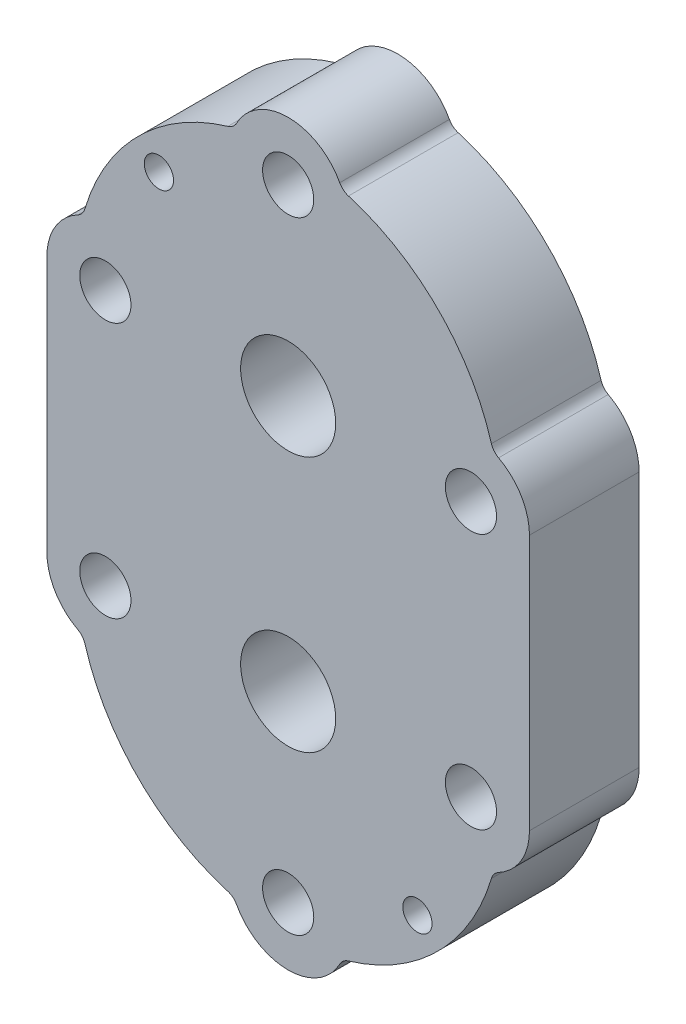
ISO-10303-21;
HEADER;
FILE_DESCRIPTION(('STEP AP214'),'2;1');
FILE_NAME('part.step','',(''),(''),'','','');
FILE_SCHEMA(('AUTOMOTIVE_DESIGN { 1 0 10303 214 1 1 1 1 }'));
ENDSEC;
DATA;
#1=APPLICATION_CONTEXT('core data for automotive mechanical design processes');
#2=APPLICATION_PROTOCOL_DEFINITION('international standard','automotive_design',2000,#1);
#3=PRODUCT_CONTEXT('',#1,'mechanical');
#4=PRODUCT('Part','Part','',(#3));
#5=PRODUCT_RELATED_PRODUCT_CATEGORY('part','',(#4));
#6=PRODUCT_DEFINITION_FORMATION('','',#4);
#7=PRODUCT_DEFINITION_CONTEXT('part definition',#1,'design');
#8=PRODUCT_DEFINITION('design','',#6,#7);
#9=PRODUCT_DEFINITION_SHAPE('','',#8);
#10=(LENGTH_UNIT() NAMED_UNIT(*) SI_UNIT(.MILLI.,.METRE.));
#11=(NAMED_UNIT(*) PLANE_ANGLE_UNIT() SI_UNIT($,.RADIAN.));
#12=(NAMED_UNIT(*) SI_UNIT($,.STERADIAN.) SOLID_ANGLE_UNIT());
#13=UNCERTAINTY_MEASURE_WITH_UNIT(LENGTH_MEASURE(1.E-05),#10,'distance_accuracy_value','');
#14=(GEOMETRIC_REPRESENTATION_CONTEXT(3) GLOBAL_UNCERTAINTY_ASSIGNED_CONTEXT((#13)) GLOBAL_UNIT_ASSIGNED_CONTEXT((#10,
#11,#12)) REPRESENTATION_CONTEXT('',''));
#15=CARTESIAN_POINT('',(0.,0.,0.));
#16=DIRECTION('',(0.,0.,1.));
#17=DIRECTION('',(1.,0.,0.));
#18=AXIS2_PLACEMENT_3D('',#15,#16,#17);
#19=CARTESIAN_POINT('',(25.,0.,-9.89949493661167));
#20=DIRECTION('',(0.,0.,1.));
#21=DIRECTION('',(1.,0.,0.));
#22=AXIS2_PLACEMENT_3D('',#19,#20,#21);
#23=CYLINDRICAL_SURFACE('',#22,3.5);
#24=CARTESIAN_POINT('',(25.,0.,15.));
#25=DIRECTION('',(0.,0.,1.));
#26=DIRECTION('',(1.,0.,0.));
#27=AXIS2_PLACEMENT_3D('',#24,#25,#26);
#28=CIRCLE('',#27,3.5);
#29=CARTESIAN_POINT('',(28.5,0.,15.));
#30=VERTEX_POINT('',#29);
#31=EDGE_CURVE('E301',#30,#30,#28,.T.);
#32=ORIENTED_EDGE('',*,*,#31,.T.);
#33=EDGE_LOOP('',(#32));
#34=FACE_BOUND('',#33,.T.);
#35=CARTESIAN_POINT('',(25.,0.,4.));
#36=DIRECTION('',(0.,0.,-1.));
#37=DIRECTION('',(-1.,0.,0.));
#38=AXIS2_PLACEMENT_3D('',#35,#36,#37);
#39=CIRCLE('',#38,3.5);
#40=CARTESIAN_POINT('',(21.5,0.,4.));
#41=VERTEX_POINT('',#40);
#42=EDGE_CURVE('E43',#41,#41,#39,.F.);
#43=ORIENTED_EDGE('',*,*,#42,.F.);
#44=EDGE_LOOP('',(#43));
#45=FACE_BOUND('',#44,.T.);
#46=ADVANCED_FACE('F39',(#34,#45),#23,.F.);
#47=CARTESIAN_POINT('',(0.,25.,-9.89949493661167));
#48=DIRECTION('',(0.,0.,1.));
#49=DIRECTION('',(1.,0.,0.));
#50=AXIS2_PLACEMENT_3D('',#47,#48,#49);
#51=CYLINDRICAL_SURFACE('',#50,3.5);
#52=CARTESIAN_POINT('',(0.,25.,15.));
#53=DIRECTION('',(0.,0.,1.));
#54=DIRECTION('',(1.,0.,0.));
#55=AXIS2_PLACEMENT_3D('',#52,#53,#54);
#56=CIRCLE('',#55,3.5);
#57=CARTESIAN_POINT('',(3.5,25.,15.));
#58=VERTEX_POINT('',#57);
#59=EDGE_CURVE('E291',#58,#58,#56,.T.);
#60=ORIENTED_EDGE('',*,*,#59,.T.);
#61=EDGE_LOOP('',(#60));
#62=FACE_BOUND('',#61,.T.);
#63=CARTESIAN_POINT('',(0.,25.,4.));
#64=DIRECTION('',(0.,0.,-1.));
#65=DIRECTION('',(-1.,0.,0.));
#66=AXIS2_PLACEMENT_3D('',#63,#64,#65);
#67=CIRCLE('',#66,3.5);
#68=CARTESIAN_POINT('',(-3.5,25.,4.));
#69=VERTEX_POINT('',#68);
#70=EDGE_CURVE('E532',#69,#69,#67,.F.);
#71=ORIENTED_EDGE('',*,*,#70,.F.);
#72=EDGE_LOOP('',(#71));
#73=FACE_BOUND('',#72,.T.);
#74=ADVANCED_FACE('F542',(#62,#73),#51,.F.);
#75=CARTESIAN_POINT('',(0.,-60.,-9.89949493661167));
#76=DIRECTION('',(0.,0.,1.));
#77=DIRECTION('',(1.,0.,0.));
#78=AXIS2_PLACEMENT_3D('',#75,#76,#77);
#79=CYLINDRICAL_SURFACE('',#78,3.5);
#80=CARTESIAN_POINT('',(0.,-60.,15.));
#81=DIRECTION('',(0.,0.,1.));
#82=DIRECTION('',(1.,0.,0.));
#83=AXIS2_PLACEMENT_3D('',#80,#81,#82);
#84=CIRCLE('',#83,3.5);
#85=CARTESIAN_POINT('',(3.5,-60.,15.));
#86=VERTEX_POINT('',#85);
#87=EDGE_CURVE('E294',#86,#86,#84,.T.);
#88=ORIENTED_EDGE('',*,*,#87,.T.);
#89=EDGE_LOOP('',(#88));
#90=FACE_BOUND('',#89,.T.);
#91=CARTESIAN_POINT('',(0.,-60.,4.));
#92=DIRECTION('',(0.,0.,-1.));
#93=DIRECTION('',(-1.,0.,0.));
#94=AXIS2_PLACEMENT_3D('',#91,#92,#93);
#95=CIRCLE('',#94,3.5);
#96=CARTESIAN_POINT('',(-3.50000000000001,-60.,4.));
#97=VERTEX_POINT('',#96);
#98=EDGE_CURVE('E530',#97,#97,#95,.F.);
#99=ORIENTED_EDGE('',*,*,#98,.F.);
#100=EDGE_LOOP('',(#99));
#101=FACE_BOUND('',#100,.T.);
#102=ADVANCED_FACE('F549',(#90,#101),#79,.F.);
#103=CARTESIAN_POINT('',(25.,-35.,-9.89949493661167));
#104=DIRECTION('',(0.,0.,1.));
#105=DIRECTION('',(1.,0.,0.));
#106=AXIS2_PLACEMENT_3D('',#103,#104,#105);
#107=CYLINDRICAL_SURFACE('',#106,3.5);
#108=CARTESIAN_POINT('',(25.,-35.,15.));
#109=DIRECTION('',(0.,0.,1.));
#110=DIRECTION('',(1.,0.,0.));
#111=AXIS2_PLACEMENT_3D('',#108,#109,#110);
#112=CIRCLE('',#111,3.5);
#113=CARTESIAN_POINT('',(28.5,-35.,15.));
#114=VERTEX_POINT('',#113);
#115=EDGE_CURVE('E298',#114,#114,#112,.T.);
#116=ORIENTED_EDGE('',*,*,#115,.T.);
#117=EDGE_LOOP('',(#116));
#118=FACE_BOUND('',#117,.T.);
#119=CARTESIAN_POINT('',(25.,-35.,4.));
#120=DIRECTION('',(0.,0.,-1.));
#121=DIRECTION('',(-1.,0.,0.));
#122=AXIS2_PLACEMENT_3D('',#119,#120,#121);
#123=CIRCLE('',#122,3.5);
#124=CARTESIAN_POINT('',(21.5,-35.,4.));
#125=VERTEX_POINT('',#124);
#126=EDGE_CURVE('E527',#125,#125,#123,.F.);
#127=ORIENTED_EDGE('',*,*,#126,.F.);
#128=EDGE_LOOP('',(#127));
#129=FACE_BOUND('',#128,.T.);
#130=ADVANCED_FACE('F953',(#118,#129),#107,.F.);
#131=CARTESIAN_POINT('',(-25.,0.,-9.89949493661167));
#132=DIRECTION('',(0.,0.,1.));
#133=DIRECTION('',(1.,0.,0.));
#134=AXIS2_PLACEMENT_3D('',#131,#132,#133);
#135=CYLINDRICAL_SURFACE('',#134,3.5);
#136=CARTESIAN_POINT('',(-25.,0.,15.));
#137=DIRECTION('',(0.,0.,1.));
#138=DIRECTION('',(1.,0.,0.));
#139=AXIS2_PLACEMENT_3D('',#136,#137,#138);
#140=CIRCLE('',#139,3.5);
#141=CARTESIAN_POINT('',(-21.5,0.,15.));
#142=VERTEX_POINT('',#141);
#143=EDGE_CURVE('E307',#142,#142,#140,.T.);
#144=ORIENTED_EDGE('',*,*,#143,.T.);
#145=EDGE_LOOP('',(#144));
#146=FACE_BOUND('',#145,.T.);
#147=CARTESIAN_POINT('',(-25.,0.,4.));
#148=DIRECTION('',(0.,0.,-1.));
#149=DIRECTION('',(-1.,0.,0.));
#150=AXIS2_PLACEMENT_3D('',#147,#148,#149);
#151=CIRCLE('',#150,3.5);
#152=CARTESIAN_POINT('',(-28.5,0.,4.));
#153=VERTEX_POINT('',#152);
#154=EDGE_CURVE('E524',#153,#153,#151,.F.);
#155=ORIENTED_EDGE('',*,*,#154,.F.);
#156=EDGE_LOOP('',(#155));
#157=FACE_BOUND('',#156,.T.);
#158=ADVANCED_FACE('F945',(#146,#157),#135,.F.);
#159=CARTESIAN_POINT('',(-25.,-35.,-9.89949493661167));
#160=DIRECTION('',(0.,0.,1.));
#161=DIRECTION('',(1.,0.,0.));
#162=AXIS2_PLACEMENT_3D('',#159,#160,#161);
#163=CYLINDRICAL_SURFACE('',#162,3.5);
#164=CARTESIAN_POINT('',(-25.,-35.,15.));
#165=DIRECTION('',(0.,0.,1.));
#166=DIRECTION('',(1.,0.,0.));
#167=AXIS2_PLACEMENT_3D('',#164,#165,#166);
#168=CIRCLE('',#167,3.5);
#169=CARTESIAN_POINT('',(-21.5,-35.,15.));
#170=VERTEX_POINT('',#169);
#171=EDGE_CURVE('E312',#170,#170,#168,.T.);
#172=ORIENTED_EDGE('',*,*,#171,.T.);
#173=EDGE_LOOP('',(#172));
#174=FACE_BOUND('',#173,.T.);
#175=CARTESIAN_POINT('',(-25.,-35.,4.));
#176=DIRECTION('',(0.,0.,-1.));
#177=DIRECTION('',(-1.,0.,0.));
#178=AXIS2_PLACEMENT_3D('',#175,#176,#177);
#179=CIRCLE('',#178,3.5);
#180=CARTESIAN_POINT('',(-28.5,-35.,4.));
#181=VERTEX_POINT('',#180);
#182=EDGE_CURVE('E254',#181,#181,#179,.F.);
#183=ORIENTED_EDGE('',*,*,#182,.F.);
#184=EDGE_LOOP('',(#183));
#185=FACE_BOUND('',#184,.T.);
#186=ADVANCED_FACE('F554',(#174,#185),#163,.F.);
#187=CARTESIAN_POINT('',(0.,0.,0.));
#188=DIRECTION('',(0.,0.,1.));
#189=DIRECTION('',(1.,0.,0.));
#190=AXIS2_PLACEMENT_3D('',#187,#188,#189);
#191=PLANE('',#190);
#192=CARTESIAN_POINT('',(0.,-60.,0.));
#193=DIRECTION('',(0.,0.,-1.));
#194=DIRECTION('',(-1.,0.,0.));
#195=AXIS2_PLACEMENT_3D('',#192,#193,#194);
#196=CIRCLE('',#195,5.5);
#197=CARTESIAN_POINT('',(-5.5,-60.,0.));
#198=VERTEX_POINT('',#197);
#199=EDGE_CURVE('E255',#198,#198,#196,.T.);
#200=ORIENTED_EDGE('',*,*,#199,.F.);
#201=EDGE_LOOP('',(#200));
#202=FACE_BOUND('',#201,.T.);
#203=CARTESIAN_POINT('',(25.,-35.,0.));
#204=DIRECTION('',(0.,0.,-1.));
#205=DIRECTION('',(-1.,0.,0.));
#206=AXIS2_PLACEMENT_3D('',#203,#204,#205);
#207=CIRCLE('',#206,5.5);
#208=CARTESIAN_POINT('',(19.5,-35.,0.));
#209=VERTEX_POINT('',#208);
#210=EDGE_CURVE('E258',#209,#209,#207,.T.);
#211=ORIENTED_EDGE('',*,*,#210,.F.);
#212=EDGE_LOOP('',(#211));
#213=FACE_BOUND('',#212,.T.);
#214=CARTESIAN_POINT('',(25.,0.,0.));
#215=DIRECTION('',(0.,0.,-1.));
#216=DIRECTION('',(-1.,0.,0.));
#217=AXIS2_PLACEMENT_3D('',#214,#215,#216);
#218=CIRCLE('',#217,5.5);
#219=CARTESIAN_POINT('',(19.5,0.,0.));
#220=VERTEX_POINT('',#219);
#221=EDGE_CURVE('E264',#220,#220,#218,.T.);
#222=ORIENTED_EDGE('',*,*,#221,.F.);
#223=EDGE_LOOP('',(#222));
#224=FACE_BOUND('',#223,.T.);
#225=CARTESIAN_POINT('',(-25.,-35.,0.));
#226=DIRECTION('',(0.,0.,-1.));
#227=DIRECTION('',(-1.,0.,0.));
#228=AXIS2_PLACEMENT_3D('',#225,#226,#227);
#229=CIRCLE('',#228,5.5);
#230=CARTESIAN_POINT('',(-30.5,-35.,0.));
#231=VERTEX_POINT('',#230);
#232=EDGE_CURVE('E270',#231,#231,#229,.T.);
#233=ORIENTED_EDGE('',*,*,#232,.F.);
#234=EDGE_LOOP('',(#233));
#235=FACE_BOUND('',#234,.T.);
#236=CARTESIAN_POINT('',(-25.,0.,0.));
#237=DIRECTION('',(0.,0.,-1.));
#238=DIRECTION('',(-1.,0.,0.));
#239=AXIS2_PLACEMENT_3D('',#236,#237,#238);
#240=CIRCLE('',#239,5.5);
#241=CARTESIAN_POINT('',(-30.5,0.,0.));
#242=VERTEX_POINT('',#241);
#243=EDGE_CURVE('E276',#242,#242,#240,.T.);
#244=ORIENTED_EDGE('',*,*,#243,.F.);
#245=EDGE_LOOP('',(#244));
#246=FACE_BOUND('',#245,.T.);
#247=CARTESIAN_POINT('',(0.,25.,0.));
#248=DIRECTION('',(0.,0.,-1.));
#249=DIRECTION('',(-1.,0.,0.));
#250=AXIS2_PLACEMENT_3D('',#247,#248,#249);
#251=CIRCLE('',#250,5.5);
#252=CARTESIAN_POINT('',(-5.5,25.,0.));
#253=VERTEX_POINT('',#252);
#254=EDGE_CURVE('E282',#253,#253,#251,.T.);
#255=ORIENTED_EDGE('',*,*,#254,.F.);
#256=EDGE_LOOP('',(#255));
#257=FACE_BOUND('',#256,.T.);
#258=CARTESIAN_POINT('',(-17.6776695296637,17.6776695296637,0.));
#259=DIRECTION('',(0.,0.,1.));
#260=DIRECTION('',(1.,0.,0.));
#261=AXIS2_PLACEMENT_3D('',#258,#259,#260);
#262=CIRCLE('',#261,2.);
#263=CARTESIAN_POINT('',(-15.6776695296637,17.6776695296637,0.));
#264=VERTEX_POINT('',#263);
#265=EDGE_CURVE('E297',#264,#264,#262,.F.);
#266=ORIENTED_EDGE('',*,*,#265,.F.);
#267=EDGE_LOOP('',(#266));
#268=FACE_BOUND('',#267,.T.);
#269=CARTESIAN_POINT('',(17.6776695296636,-52.6776695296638,0.));
#270=DIRECTION('',(0.,0.,1.));
#271=DIRECTION('',(1.,0.,0.));
#272=AXIS2_PLACEMENT_3D('',#269,#270,#271);
#273=CIRCLE('',#272,2.);
#274=CARTESIAN_POINT('',(19.6776695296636,-52.6776695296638,0.));
#275=VERTEX_POINT('',#274);
#276=EDGE_CURVE('E290',#275,#275,#273,.F.);
#277=ORIENTED_EDGE('',*,*,#276,.F.);
#278=EDGE_LOOP('',(#277));
#279=FACE_BOUND('',#278,.T.);
#280=DIRECTION('',(0.,1.,0.));
#281=VECTOR('',#280,1.);
#282=CARTESIAN_POINT('',(-16.,-35.,0.));
#283=LINE('',#282,#281);
#284=CARTESIAN_POINT('',(-16.,0.,0.));
#285=VERTEX_POINT('',#284);
#286=CARTESIAN_POINT('',(-16.,-35.,0.));
#287=VERTEX_POINT('',#286);
#288=EDGE_CURVE('E500',#285,#287,#283,.F.);
#289=ORIENTED_EDGE('',*,*,#288,.T.);
#290=CARTESIAN_POINT('',(0.,-35.,0.));
#291=DIRECTION('',(0.,0.,1.));
#292=DIRECTION('',(1.,0.,0.));
#293=AXIS2_PLACEMENT_3D('',#290,#291,#292);
#294=CIRCLE('',#293,16.);
#295=CARTESIAN_POINT('',(16.,-35.,0.));
#296=VERTEX_POINT('',#295);
#297=EDGE_CURVE('E11',#287,#296,#294,.T.);
#298=ORIENTED_EDGE('',*,*,#297,.T.);
#299=DIRECTION('',(0.,-1.,0.));
#300=VECTOR('',#299,1.);
#301=CARTESIAN_POINT('',(16.,0.,0.));
#302=LINE('',#301,#300);
#303=CARTESIAN_POINT('',(16.,0.,0.));
#304=VERTEX_POINT('',#303);
#305=EDGE_CURVE('E48',#296,#304,#302,.F.);
#306=ORIENTED_EDGE('',*,*,#305,.T.);
#307=CARTESIAN_POINT('',(0.,0.,0.));
#308=DIRECTION('',(0.,0.,1.));
#309=DIRECTION('',(1.,0.,0.));
#310=AXIS2_PLACEMENT_3D('',#307,#308,#309);
#311=CIRCLE('',#310,16.);
#312=EDGE_CURVE('E502',#304,#285,#311,.T.);
#313=ORIENTED_EDGE('',*,*,#312,.T.);
#314=EDGE_LOOP('',(#289,#298,#306,#313));
#315=FACE_BOUND('',#314,.T.);
#316=CARTESIAN_POINT('',(0.,0.,0.));
#317=DIRECTION('',(0.,0.,1.));
#318=DIRECTION('',(1.,0.,0.));
#319=AXIS2_PLACEMENT_3D('',#316,#317,#318);
#320=CIRCLE('',#319,29.);
#321=CARTESIAN_POINT('',(27.8025806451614,8.24721222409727,0.));
#322=VERTEX_POINT('',#321);
#323=CARTESIAN_POINT('',(8.24721222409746,27.8025806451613,0.));
#324=VERTEX_POINT('',#323);
#325=EDGE_CURVE('E398',#322,#324,#320,.T.);
#326=ORIENTED_EDGE('',*,*,#325,.F.);
#327=CARTESIAN_POINT('',(29.7200000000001,8.81598548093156,0.));
#328=DIRECTION('',(0.,0.,1.));
#329=DIRECTION('',(1.,0.,0.));
#330=AXIS2_PLACEMENT_3D('',#327,#328,#329);
#331=CIRCLE('',#330,2.);
#332=CARTESIAN_POINT('',(28.7760000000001,7.05278838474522,0.));
#333=VERTEX_POINT('',#332);
#334=EDGE_CURVE('E449',#322,#333,#331,.T.);
#335=ORIENTED_EDGE('',*,*,#334,.T.);
#336=CARTESIAN_POINT('',(25.,-1.74574066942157E-13,0.));
#337=DIRECTION('',(0.,0.,-1.));
#338=DIRECTION('',(-1.,0.,0.));
#339=AXIS2_PLACEMENT_3D('',#336,#337,#338);
#340=CIRCLE('',#339,8.);
#341=CARTESIAN_POINT('',(33.,-2.30437768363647E-13,0.));
#342=VERTEX_POINT('',#341);
#343=EDGE_CURVE('E339',#333,#342,#340,.T.);
#344=ORIENTED_EDGE('',*,*,#343,.T.);
#345=DIRECTION('',(0.,-1.,0.));
#346=VECTOR('',#345,1.);
#347=CARTESIAN_POINT('',(33.,-35.0000000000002,0.));
#348=LINE('',#347,#346);
#349=CARTESIAN_POINT('',(33.,-35.0000000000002,0.));
#350=VERTEX_POINT('',#349);
#351=EDGE_CURVE('E336',#342,#350,#348,.T.);
#352=ORIENTED_EDGE('',*,*,#351,.T.);
#353=CARTESIAN_POINT('',(25.,-35.0000000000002,0.));
#354=DIRECTION('',(0.,0.,-1.));
#355=DIRECTION('',(-1.,0.,0.));
#356=AXIS2_PLACEMENT_3D('',#353,#354,#355);
#357=CIRCLE('',#356,8.);
#358=CARTESIAN_POINT('',(28.7759999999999,-42.0527883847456,0.));
#359=VERTEX_POINT('',#358);
#360=EDGE_CURVE('E332',#350,#359,#357,.T.);
#361=ORIENTED_EDGE('',*,*,#360,.T.);
#362=CARTESIAN_POINT('',(29.7199999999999,-43.815985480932,0.));
#363=DIRECTION('',(0.,0.,1.));
#364=DIRECTION('',(1.,0.,0.));
#365=AXIS2_PLACEMENT_3D('',#362,#363,#364);
#366=CIRCLE('',#365,2.);
#367=CARTESIAN_POINT('',(27.8025806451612,-43.2472122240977,0.));
#368=VERTEX_POINT('',#367);
#369=EDGE_CURVE('E445',#359,#368,#366,.T.);
#370=ORIENTED_EDGE('',*,*,#369,.T.);
#371=CARTESIAN_POINT('',(0.,-35.,0.));
#372=DIRECTION('',(0.,0.,1.));
#373=DIRECTION('',(1.,0.,0.));
#374=AXIS2_PLACEMENT_3D('',#371,#372,#373);
#375=CIRCLE('',#374,29.);
#376=CARTESIAN_POINT('',(8.24721222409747,-62.8025806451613,0.));
#377=VERTEX_POINT('',#376);
#378=EDGE_CURVE('E401',#377,#368,#375,.T.);
#379=ORIENTED_EDGE('',*,*,#378,.F.);
#380=CARTESIAN_POINT('',(8.81598548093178,-64.72,0.));
#381=DIRECTION('',(0.,0.,1.));
#382=DIRECTION('',(1.,0.,0.));
#383=AXIS2_PLACEMENT_3D('',#380,#381,#382);
#384=CIRCLE('',#383,2.);
#385=CARTESIAN_POINT('',(7.05278838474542,-63.776,0.));
#386=VERTEX_POINT('',#385);
#387=EDGE_CURVE('E441',#377,#386,#384,.T.);
#388=ORIENTED_EDGE('',*,*,#387,.T.);
#389=CARTESIAN_POINT('',(0.,-60.,0.));
#390=DIRECTION('',(0.,0.,-1.));
#391=DIRECTION('',(-1.,0.,0.));
#392=AXIS2_PLACEMENT_3D('',#389,#390,#391);
#393=CIRCLE('',#392,7.99999999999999);
#394=CARTESIAN_POINT('',(-7.05278838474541,-63.776,0.));
#395=VERTEX_POINT('',#394);
#396=EDGE_CURVE('E379',#386,#395,#393,.T.);
#397=ORIENTED_EDGE('',*,*,#396,.T.);
#398=CARTESIAN_POINT('',(-8.81598548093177,-64.72,0.));
#399=DIRECTION('',(0.,0.,1.));
#400=DIRECTION('',(1.,0.,0.));
#401=AXIS2_PLACEMENT_3D('',#398,#399,#400);
#402=CIRCLE('',#401,2.);
#403=CARTESIAN_POINT('',(-8.24721222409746,-62.8025806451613,0.));
#404=VERTEX_POINT('',#403);
#405=EDGE_CURVE('E469',#395,#404,#402,.T.);
#406=ORIENTED_EDGE('',*,*,#405,.T.);
#407=CARTESIAN_POINT('',(-27.8025806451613,-43.2472122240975,0.));
#408=VERTEX_POINT('',#407);
#409=EDGE_CURVE('E390',#408,#404,#375,.T.);
#410=ORIENTED_EDGE('',*,*,#409,.F.);
#411=CARTESIAN_POINT('',(-29.72,-43.8159854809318,0.));
#412=DIRECTION('',(0.,0.,1.));
#413=DIRECTION('',(1.,0.,0.));
#414=AXIS2_PLACEMENT_3D('',#411,#412,#413);
#415=CIRCLE('',#414,2.);
#416=CARTESIAN_POINT('',(-28.776,-42.0527883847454,0.));
#417=VERTEX_POINT('',#416);
#418=EDGE_CURVE('E465',#408,#417,#415,.T.);
#419=ORIENTED_EDGE('',*,*,#418,.T.);
#420=CARTESIAN_POINT('',(-25.,-35.,0.));
#421=DIRECTION('',(0.,0.,-1.));
#422=DIRECTION('',(-1.,0.,0.));
#423=AXIS2_PLACEMENT_3D('',#420,#421,#422);
#424=CIRCLE('',#423,8.);
#425=CARTESIAN_POINT('',(-33.,-35.,0.));
#426=VERTEX_POINT('',#425);
#427=EDGE_CURVE('E341',#417,#426,#424,.T.);
#428=ORIENTED_EDGE('',*,*,#427,.T.);
#429=DIRECTION('',(0.,1.,0.));
#430=VECTOR('',#429,1.);
#431=CARTESIAN_POINT('',(-33.,0.,0.));
#432=LINE('',#431,#430);
#433=CARTESIAN_POINT('',(-33.,0.,0.));
#434=VERTEX_POINT('',#433);
#435=EDGE_CURVE('E371',#426,#434,#432,.T.);
#436=ORIENTED_EDGE('',*,*,#435,.T.);
#437=CARTESIAN_POINT('',(-25.,0.,0.));
#438=DIRECTION('',(0.,0.,-1.));
#439=DIRECTION('',(-1.,0.,0.));
#440=AXIS2_PLACEMENT_3D('',#437,#438,#439);
#441=CIRCLE('',#440,8.);
#442=CARTESIAN_POINT('',(-28.776,7.05278838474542,0.));
#443=VERTEX_POINT('',#442);
#444=EDGE_CURVE('E369',#434,#443,#441,.T.);
#445=ORIENTED_EDGE('',*,*,#444,.T.);
#446=CARTESIAN_POINT('',(-29.72,8.81598548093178,0.));
#447=DIRECTION('',(0.,0.,1.));
#448=DIRECTION('',(1.,0.,0.));
#449=AXIS2_PLACEMENT_3D('',#446,#447,#448);
#450=CIRCLE('',#449,2.);
#451=CARTESIAN_POINT('',(-27.8025806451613,8.24721222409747,0.));
#452=VERTEX_POINT('',#451);
#453=EDGE_CURVE('E461',#443,#452,#450,.T.);
#454=ORIENTED_EDGE('',*,*,#453,.T.);
#455=CARTESIAN_POINT('',(-8.24721222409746,27.8025806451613,0.));
#456=VERTEX_POINT('',#455);
#457=EDGE_CURVE('E347',#456,#452,#320,.T.);
#458=ORIENTED_EDGE('',*,*,#457,.F.);
#459=CARTESIAN_POINT('',(-8.81598548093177,29.72,0.));
#460=DIRECTION('',(0.,0.,1.));
#461=DIRECTION('',(1.,0.,0.));
#462=AXIS2_PLACEMENT_3D('',#459,#460,#461);
#463=CIRCLE('',#462,2.);
#464=CARTESIAN_POINT('',(-7.05278838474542,28.776,0.));
#465=VERTEX_POINT('',#464);
#466=EDGE_CURVE('E457',#456,#465,#463,.T.);
#467=ORIENTED_EDGE('',*,*,#466,.T.);
#468=CARTESIAN_POINT('',(0.,25.,0.));
#469=DIRECTION('',(0.,0.,-1.));
#470=DIRECTION('',(-1.,0.,0.));
#471=AXIS2_PLACEMENT_3D('',#468,#469,#470);
#472=CIRCLE('',#471,7.99999999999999);
#473=CARTESIAN_POINT('',(7.05278838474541,28.776,0.));
#474=VERTEX_POINT('',#473);
#475=EDGE_CURVE('E367',#465,#474,#472,.T.);
#476=ORIENTED_EDGE('',*,*,#475,.T.);
#477=CARTESIAN_POINT('',(8.81598548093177,29.72,0.));
#478=DIRECTION('',(0.,0.,1.));
#479=DIRECTION('',(1.,0.,0.));
#480=AXIS2_PLACEMENT_3D('',#477,#478,#479);
#481=CIRCLE('',#480,2.);
#482=EDGE_CURVE('E453',#474,#324,#481,.T.);
#483=ORIENTED_EDGE('',*,*,#482,.T.);
#484=EDGE_LOOP('',(#326,#335,#344,#352,#361,#370,#379,#388,#397,#406,#410,#419,#428,#436,#445,
#454,#458,#467,#476,#483));
#485=FACE_BOUND('',#484,.T.);
#486=ADVANCED_FACE('F616',(#202,#213,#224,#235,#246,#257,#268,#279,#315,#485),#191,.F.);
#487=CARTESIAN_POINT('',(0.,0.,15.));
#488=DIRECTION('',(0.,0.,-1.));
#489=DIRECTION('',(-1.,0.,0.));
#490=AXIS2_PLACEMENT_3D('',#487,#488,#489);
#491=CYLINDRICAL_SURFACE('',#490,29.);
#492=CARTESIAN_POINT('',(0.,0.,15.));
#493=DIRECTION('',(0.,0.,1.));
#494=DIRECTION('',(1.,0.,0.));
#495=AXIS2_PLACEMENT_3D('',#492,#493,#494);
#496=CIRCLE('',#495,29.);
#497=CARTESIAN_POINT('',(27.8025806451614,8.24721222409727,15.));
#498=VERTEX_POINT('',#497);
#499=CARTESIAN_POINT('',(8.24721222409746,27.8025806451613,15.));
#500=VERTEX_POINT('',#499);
#501=EDGE_CURVE('E389',#498,#500,#496,.T.);
#502=ORIENTED_EDGE('',*,*,#501,.F.);
#503=DIRECTION('',(0.,0.,-1.));
#504=VECTOR('',#503,1.);
#505=CARTESIAN_POINT('',(27.8025806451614,8.24721222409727,15.));
#506=LINE('',#505,#504);
#507=EDGE_CURVE('E416',#498,#322,#506,.T.);
#508=ORIENTED_EDGE('',*,*,#507,.T.);
#509=ORIENTED_EDGE('',*,*,#325,.T.);
#510=DIRECTION('',(0.,0.,-1.));
#511=VECTOR('',#510,1.);
#512=CARTESIAN_POINT('',(8.24721222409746,27.8025806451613,15.));
#513=LINE('',#512,#511);
#514=EDGE_CURVE('E414',#324,#500,#513,.F.);
#515=ORIENTED_EDGE('',*,*,#514,.T.);
#516=EDGE_LOOP('',(#502,#508,#509,#515));
#517=FACE_BOUND('',#516,.T.);
#518=ADVANCED_FACE('F619',(#517),#491,.T.);
#519=CARTESIAN_POINT('',(0.,-35.,15.));
#520=DIRECTION('',(0.,0.,-1.));
#521=DIRECTION('',(-1.,0.,0.));
#522=AXIS2_PLACEMENT_3D('',#519,#520,#521);
#523=CYLINDRICAL_SURFACE('',#522,29.);
#524=CARTESIAN_POINT('',(0.,-35.,15.));
#525=DIRECTION('',(0.,0.,1.));
#526=DIRECTION('',(1.,0.,0.));
#527=AXIS2_PLACEMENT_3D('',#524,#525,#526);
#528=CIRCLE('',#527,29.);
#529=CARTESIAN_POINT('',(-27.8025806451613,-43.2472122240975,15.));
#530=VERTEX_POINT('',#529);
#531=CARTESIAN_POINT('',(-8.24721222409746,-62.8025806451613,15.));
#532=VERTEX_POINT('',#531);
#533=EDGE_CURVE('E391',#530,#532,#528,.T.);
#534=ORIENTED_EDGE('',*,*,#533,.F.);
#535=DIRECTION('',(0.,0.,-1.));
#536=VECTOR('',#535,1.);
#537=CARTESIAN_POINT('',(-27.8025806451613,-43.2472122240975,15.));
#538=LINE('',#537,#536);
#539=EDGE_CURVE('E436',#530,#408,#538,.T.);
#540=ORIENTED_EDGE('',*,*,#539,.T.);
#541=ORIENTED_EDGE('',*,*,#409,.T.);
#542=DIRECTION('',(0.,0.,-1.));
#543=VECTOR('',#542,1.);
#544=CARTESIAN_POINT('',(-8.24721222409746,-62.8025806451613,15.));
#545=LINE('',#544,#543);
#546=EDGE_CURVE('E434',#404,#532,#545,.F.);
#547=ORIENTED_EDGE('',*,*,#546,.T.);
#548=EDGE_LOOP('',(#534,#540,#541,#547));
#549=FACE_BOUND('',#548,.T.);
#550=ADVANCED_FACE('F625',(#549),#523,.T.);
#551=CARTESIAN_POINT('',(-8.24721222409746,27.8025806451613,15.));
#552=VERTEX_POINT('',#551);
#553=CARTESIAN_POINT('',(-27.8025806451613,8.24721222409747,15.));
#554=VERTEX_POINT('',#553);
#555=EDGE_CURVE('E386',#552,#554,#496,.T.);
#556=ORIENTED_EDGE('',*,*,#555,.F.);
#557=DIRECTION('',(0.,0.,-1.));
#558=VECTOR('',#557,1.);
#559=CARTESIAN_POINT('',(-8.24721222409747,27.8025806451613,15.));
#560=LINE('',#559,#558);
#561=EDGE_CURVE('E428',#552,#456,#560,.T.);
#562=ORIENTED_EDGE('',*,*,#561,.T.);
#563=ORIENTED_EDGE('',*,*,#457,.T.);
#564=DIRECTION('',(0.,0.,-1.));
#565=VECTOR('',#564,1.);
#566=CARTESIAN_POINT('',(-27.8025806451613,8.24721222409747,15.));
#567=LINE('',#566,#565);
#568=EDGE_CURVE('E426',#452,#554,#567,.F.);
#569=ORIENTED_EDGE('',*,*,#568,.T.);
#570=EDGE_LOOP('',(#556,#562,#563,#569));
#571=FACE_BOUND('',#570,.T.);
#572=ADVANCED_FACE('F623',(#571),#491,.T.);
#573=CARTESIAN_POINT('',(8.24721222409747,-62.8025806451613,15.));
#574=VERTEX_POINT('',#573);
#575=CARTESIAN_POINT('',(27.8025806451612,-43.2472122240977,15.));
#576=VERTEX_POINT('',#575);
#577=EDGE_CURVE('E395',#574,#576,#528,.T.);
#578=ORIENTED_EDGE('',*,*,#577,.F.);
#579=DIRECTION('',(0.,0.,-1.));
#580=VECTOR('',#579,1.);
#581=CARTESIAN_POINT('',(8.24721222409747,-62.8025806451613,15.));
#582=LINE('',#581,#580);
#583=EDGE_CURVE('E403',#574,#377,#582,.T.);
#584=ORIENTED_EDGE('',*,*,#583,.T.);
#585=ORIENTED_EDGE('',*,*,#378,.T.);
#586=DIRECTION('',(0.,0.,-1.));
#587=VECTOR('',#586,1.);
#588=CARTESIAN_POINT('',(27.8025806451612,-43.2472122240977,15.));
#589=LINE('',#588,#587);
#590=EDGE_CURVE('E394',#368,#576,#589,.F.);
#591=ORIENTED_EDGE('',*,*,#590,.T.);
#592=EDGE_LOOP('',(#578,#584,#585,#591));
#593=FACE_BOUND('',#592,.T.);
#594=ADVANCED_FACE('F614',(#593),#523,.T.);
#595=CARTESIAN_POINT('',(0.,0.,15.));
#596=DIRECTION('',(0.,0.,1.));
#597=DIRECTION('',(1.,0.,0.));
#598=AXIS2_PLACEMENT_3D('',#595,#596,#597);
#599=PLANE('',#598);
#600=CARTESIAN_POINT('',(0.,-35.,15.));
#601=DIRECTION('',(0.,0.,1.));
#602=DIRECTION('',(1.,0.,0.));
#603=AXIS2_PLACEMENT_3D('',#600,#601,#602);
#604=CIRCLE('',#603,6.5);
#605=CARTESIAN_POINT('',(6.5,-35.,15.));
#606=VERTEX_POINT('',#605);
#607=EDGE_CURVE('E245',#606,#606,#604,.T.);
#608=ORIENTED_EDGE('',*,*,#607,.F.);
#609=EDGE_LOOP('',(#608));
#610=FACE_BOUND('',#609,.T.);
#611=CARTESIAN_POINT('',(0.,0.,15.));
#612=DIRECTION('',(0.,0.,1.));
#613=DIRECTION('',(1.,0.,0.));
#614=AXIS2_PLACEMENT_3D('',#611,#612,#613);
#615=CIRCLE('',#614,6.5);
#616=CARTESIAN_POINT('',(6.5,0.,15.));
#617=VERTEX_POINT('',#616);
#618=EDGE_CURVE('E242',#617,#617,#615,.T.);
#619=ORIENTED_EDGE('',*,*,#618,.F.);
#620=EDGE_LOOP('',(#619));
#621=FACE_BOUND('',#620,.T.);
#622=ORIENTED_EDGE('',*,*,#171,.F.);
#623=EDGE_LOOP('',(#622));
#624=FACE_BOUND('',#623,.T.);
#625=ORIENTED_EDGE('',*,*,#143,.F.);
#626=EDGE_LOOP('',(#625));
#627=FACE_BOUND('',#626,.T.);
#628=CARTESIAN_POINT('',(-17.6776695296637,17.6776695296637,15.));
#629=DIRECTION('',(0.,0.,1.));
#630=DIRECTION('',(1.,0.,0.));
#631=AXIS2_PLACEMENT_3D('',#628,#629,#630);
#632=CIRCLE('',#631,2.);
#633=CARTESIAN_POINT('',(-15.6776695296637,17.6776695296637,15.));
#634=VERTEX_POINT('',#633);
#635=EDGE_CURVE('E304',#634,#634,#632,.T.);
#636=ORIENTED_EDGE('',*,*,#635,.F.);
#637=EDGE_LOOP('',(#636));
#638=FACE_BOUND('',#637,.T.);
#639=ORIENTED_EDGE('',*,*,#115,.F.);
#640=EDGE_LOOP('',(#639));
#641=FACE_BOUND('',#640,.T.);
#642=ORIENTED_EDGE('',*,*,#87,.F.);
#643=EDGE_LOOP('',(#642));
#644=FACE_BOUND('',#643,.T.);
#645=CARTESIAN_POINT('',(17.6776695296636,-52.6776695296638,15.));
#646=DIRECTION('',(0.,0.,1.));
#647=DIRECTION('',(1.,0.,0.));
#648=AXIS2_PLACEMENT_3D('',#645,#646,#647);
#649=CIRCLE('',#648,2.);
#650=CARTESIAN_POINT('',(19.6776695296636,-52.6776695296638,15.));
#651=VERTEX_POINT('',#650);
#652=EDGE_CURVE('E287',#651,#651,#649,.T.);
#653=ORIENTED_EDGE('',*,*,#652,.F.);
#654=EDGE_LOOP('',(#653));
#655=FACE_BOUND('',#654,.T.);
#656=ORIENTED_EDGE('',*,*,#59,.F.);
#657=EDGE_LOOP('',(#656));
#658=FACE_BOUND('',#657,.T.);
#659=ORIENTED_EDGE('',*,*,#31,.F.);
#660=EDGE_LOOP('',(#659));
#661=FACE_BOUND('',#660,.T.);
#662=CARTESIAN_POINT('',(0.,-60.,15.));
#663=DIRECTION('',(0.,0.,1.));
#664=DIRECTION('',(1.,0.,0.));
#665=AXIS2_PLACEMENT_3D('',#662,#663,#664);
#666=CIRCLE('',#665,7.99999999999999);
#667=CARTESIAN_POINT('',(7.05278838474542,-63.776,15.));
#668=VERTEX_POINT('',#667);
#669=CARTESIAN_POINT('',(-7.05278838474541,-63.776,15.));
#670=VERTEX_POINT('',#669);
#671=EDGE_CURVE('E331',#668,#670,#666,.F.);
#672=ORIENTED_EDGE('',*,*,#671,.F.);
#673=CARTESIAN_POINT('',(8.81598548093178,-64.72,15.));
#674=DIRECTION('',(0.,0.,1.));
#675=DIRECTION('',(1.,0.,0.));
#676=AXIS2_PLACEMENT_3D('',#673,#674,#675);
#677=CIRCLE('',#676,2.);
#678=EDGE_CURVE('E443',#668,#574,#677,.F.);
#679=ORIENTED_EDGE('',*,*,#678,.T.);
#680=ORIENTED_EDGE('',*,*,#577,.T.);
#681=CARTESIAN_POINT('',(29.7199999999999,-43.815985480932,15.));
#682=DIRECTION('',(0.,0.,1.));
#683=DIRECTION('',(1.,0.,0.));
#684=AXIS2_PLACEMENT_3D('',#681,#682,#683);
#685=CIRCLE('',#684,2.);
#686=CARTESIAN_POINT('',(28.7759999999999,-42.0527883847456,15.));
#687=VERTEX_POINT('',#686);
#688=EDGE_CURVE('E447',#576,#687,#685,.F.);
#689=ORIENTED_EDGE('',*,*,#688,.T.);
#690=CARTESIAN_POINT('',(25.,-35.0000000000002,15.));
#691=DIRECTION('',(0.,0.,1.));
#692=DIRECTION('',(1.,0.,0.));
#693=AXIS2_PLACEMENT_3D('',#690,#691,#692);
#694=CIRCLE('',#693,8.);
#695=CARTESIAN_POINT('',(33.,-35.0000000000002,15.));
#696=VERTEX_POINT('',#695);
#697=EDGE_CURVE('E344',#696,#687,#694,.F.);
#698=ORIENTED_EDGE('',*,*,#697,.F.);
#699=DIRECTION('',(0.,-1.,0.));
#700=VECTOR('',#699,1.);
#701=CARTESIAN_POINT('',(33.,-35.0000000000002,15.));
#702=LINE('',#701,#700);
#703=CARTESIAN_POINT('',(33.,-2.30437768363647E-13,15.));
#704=VERTEX_POINT('',#703);
#705=EDGE_CURVE('E349',#704,#696,#702,.T.);
#706=ORIENTED_EDGE('',*,*,#705,.F.);
#707=CARTESIAN_POINT('',(25.,-1.74574066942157E-13,15.));
#708=DIRECTION('',(0.,0.,1.));
#709=DIRECTION('',(1.,0.,0.));
#710=AXIS2_PLACEMENT_3D('',#707,#708,#709);
#711=CIRCLE('',#710,8.);
#712=CARTESIAN_POINT('',(28.7760000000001,7.05278838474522,15.));
#713=VERTEX_POINT('',#712);
#714=EDGE_CURVE('E335',#713,#704,#711,.F.);
#715=ORIENTED_EDGE('',*,*,#714,.F.);
#716=CARTESIAN_POINT('',(29.7200000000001,8.81598548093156,15.));
#717=DIRECTION('',(0.,0.,1.));
#718=DIRECTION('',(1.,0.,0.));
#719=AXIS2_PLACEMENT_3D('',#716,#717,#718);
#720=CIRCLE('',#719,2.);
#721=EDGE_CURVE('E451',#713,#498,#720,.F.);
#722=ORIENTED_EDGE('',*,*,#721,.T.);
#723=ORIENTED_EDGE('',*,*,#501,.T.);
#724=CARTESIAN_POINT('',(8.81598548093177,29.72,15.));
#725=DIRECTION('',(0.,0.,1.));
#726=DIRECTION('',(1.,0.,0.));
#727=AXIS2_PLACEMENT_3D('',#724,#725,#726);
#728=CIRCLE('',#727,2.);
#729=CARTESIAN_POINT('',(7.05278838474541,28.776,15.));
#730=VERTEX_POINT('',#729);
#731=EDGE_CURVE('E455',#500,#730,#728,.F.);
#732=ORIENTED_EDGE('',*,*,#731,.T.);
#733=CARTESIAN_POINT('',(0.,25.,15.));
#734=DIRECTION('',(0.,0.,1.));
#735=DIRECTION('',(1.,0.,0.));
#736=AXIS2_PLACEMENT_3D('',#733,#734,#735);
#737=CIRCLE('',#736,7.99999999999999);
#738=CARTESIAN_POINT('',(-7.05278838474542,28.776,15.));
#739=VERTEX_POINT('',#738);
#740=EDGE_CURVE('E376',#739,#730,#737,.F.);
#741=ORIENTED_EDGE('',*,*,#740,.F.);
#742=CARTESIAN_POINT('',(-8.81598548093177,29.72,15.));
#743=DIRECTION('',(0.,0.,1.));
#744=DIRECTION('',(1.,0.,0.));
#745=AXIS2_PLACEMENT_3D('',#742,#743,#744);
#746=CIRCLE('',#745,2.);
#747=EDGE_CURVE('E459',#739,#552,#746,.F.);
#748=ORIENTED_EDGE('',*,*,#747,.T.);
#749=ORIENTED_EDGE('',*,*,#555,.T.);
#750=CARTESIAN_POINT('',(-29.72,8.81598548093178,15.));
#751=DIRECTION('',(0.,0.,1.));
#752=DIRECTION('',(1.,0.,0.));
#753=AXIS2_PLACEMENT_3D('',#750,#751,#752);
#754=CIRCLE('',#753,2.);
#755=CARTESIAN_POINT('',(-28.776,7.05278838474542,15.));
#756=VERTEX_POINT('',#755);
#757=EDGE_CURVE('E463',#554,#756,#754,.F.);
#758=ORIENTED_EDGE('',*,*,#757,.T.);
#759=CARTESIAN_POINT('',(-25.,0.,15.));
#760=DIRECTION('',(0.,0.,1.));
#761=DIRECTION('',(1.,0.,0.));
#762=AXIS2_PLACEMENT_3D('',#759,#760,#761);
#763=CIRCLE('',#762,8.);
#764=CARTESIAN_POINT('',(-33.,0.,15.));
#765=VERTEX_POINT('',#764);
#766=EDGE_CURVE('E362',#765,#756,#763,.F.);
#767=ORIENTED_EDGE('',*,*,#766,.F.);
#768=DIRECTION('',(0.,1.,0.));
#769=VECTOR('',#768,1.);
#770=CARTESIAN_POINT('',(-33.,0.,15.));
#771=LINE('',#770,#769);
#772=CARTESIAN_POINT('',(-33.,-35.,15.));
#773=VERTEX_POINT('',#772);
#774=EDGE_CURVE('E359',#773,#765,#771,.T.);
#775=ORIENTED_EDGE('',*,*,#774,.F.);
#776=CARTESIAN_POINT('',(-25.,-35.,15.));
#777=DIRECTION('',(0.,0.,1.));
#778=DIRECTION('',(1.,0.,0.));
#779=AXIS2_PLACEMENT_3D('',#776,#777,#778);
#780=CIRCLE('',#779,8.);
#781=CARTESIAN_POINT('',(-28.776,-42.0527883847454,15.));
#782=VERTEX_POINT('',#781);
#783=EDGE_CURVE('E358',#782,#773,#780,.F.);
#784=ORIENTED_EDGE('',*,*,#783,.F.);
#785=CARTESIAN_POINT('',(-29.72,-43.8159854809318,15.));
#786=DIRECTION('',(0.,0.,1.));
#787=DIRECTION('',(1.,0.,0.));
#788=AXIS2_PLACEMENT_3D('',#785,#786,#787);
#789=CIRCLE('',#788,2.);
#790=EDGE_CURVE('E467',#782,#530,#789,.F.);
#791=ORIENTED_EDGE('',*,*,#790,.T.);
#792=ORIENTED_EDGE('',*,*,#533,.T.);
#793=CARTESIAN_POINT('',(-8.81598548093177,-64.72,15.));
#794=DIRECTION('',(0.,0.,1.));
#795=DIRECTION('',(1.,0.,0.));
#796=AXIS2_PLACEMENT_3D('',#793,#794,#795);
#797=CIRCLE('',#796,2.);
#798=EDGE_CURVE('E471',#532,#670,#797,.F.);
#799=ORIENTED_EDGE('',*,*,#798,.T.);
#800=EDGE_LOOP('',(#672,#679,#680,#689,#698,#706,#715,#722,#723,#732,#741,#748,#749,#758,#767,
#775,#784,#791,#792,#799));
#801=FACE_BOUND('',#800,.T.);
#802=ADVANCED_FACE('F610',(#610,#621,#624,#627,#638,#641,#644,#655,#658,#661,#801),#599,.T.);
#803=CARTESIAN_POINT('',(0.,-60.,65.046179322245));
#804=DIRECTION('',(0.,0.,-1.));
#805=DIRECTION('',(-1.,0.,0.));
#806=AXIS2_PLACEMENT_3D('',#803,#804,#805);
#807=CYLINDRICAL_SURFACE('',#806,7.99999999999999);
#808=ORIENTED_EDGE('',*,*,#396,.F.);
#809=DIRECTION('',(0.,0.,-1.));
#810=VECTOR('',#809,1.);
#811=CARTESIAN_POINT('',(7.05278838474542,-63.776,65.046179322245));
#812=LINE('',#811,#810);
#813=EDGE_CURVE('E409',#386,#668,#812,.F.);
#814=ORIENTED_EDGE('',*,*,#813,.T.);
#815=ORIENTED_EDGE('',*,*,#671,.T.);
#816=DIRECTION('',(0.,0.,-1.));
#817=VECTOR('',#816,1.);
#818=CARTESIAN_POINT('',(-7.05278838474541,-63.776,65.046179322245));
#819=LINE('',#818,#817);
#820=EDGE_CURVE('E406',#670,#395,#819,.T.);
#821=ORIENTED_EDGE('',*,*,#820,.T.);
#822=EDGE_LOOP('',(#808,#814,#815,#821));
#823=FACE_BOUND('',#822,.T.);
#824=ADVANCED_FACE('F606',(#823),#807,.T.);
#825=CARTESIAN_POINT('',(0.,25.,65.046179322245));
#826=DIRECTION('',(0.,0.,-1.));
#827=DIRECTION('',(-1.,0.,0.));
#828=AXIS2_PLACEMENT_3D('',#825,#826,#827);
#829=CYLINDRICAL_SURFACE('',#828,7.99999999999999);
#830=ORIENTED_EDGE('',*,*,#740,.T.);
#831=DIRECTION('',(0.,0.,-1.));
#832=VECTOR('',#831,1.);
#833=CARTESIAN_POINT('',(7.05278838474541,28.776,65.046179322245));
#834=LINE('',#833,#832);
#835=EDGE_CURVE('E423',#730,#474,#834,.T.);
#836=ORIENTED_EDGE('',*,*,#835,.T.);
#837=ORIENTED_EDGE('',*,*,#475,.F.);
#838=DIRECTION('',(0.,0.,-1.));
#839=VECTOR('',#838,1.);
#840=CARTESIAN_POINT('',(-7.05278838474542,28.776,65.046179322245));
#841=LINE('',#840,#839);
#842=EDGE_CURVE('E421',#465,#739,#841,.F.);
#843=ORIENTED_EDGE('',*,*,#842,.T.);
#844=EDGE_LOOP('',(#830,#836,#837,#843));
#845=FACE_BOUND('',#844,.T.);
#846=ADVANCED_FACE('F596',(#845),#829,.T.);
#847=CARTESIAN_POINT('',(-25.,-35.,65.046179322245));
#848=DIRECTION('',(0.,0.,-1.));
#849=DIRECTION('',(-1.,0.,0.));
#850=AXIS2_PLACEMENT_3D('',#847,#848,#849);
#851=CYLINDRICAL_SURFACE('',#850,8.);
#852=ORIENTED_EDGE('',*,*,#427,.F.);
#853=DIRECTION('',(0.,0.,-1.));
#854=VECTOR('',#853,1.);
#855=CARTESIAN_POINT('',(-28.776,-42.0527883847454,65.046179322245));
#856=LINE('',#855,#854);
#857=EDGE_CURVE('E439',#417,#782,#856,.F.);
#858=ORIENTED_EDGE('',*,*,#857,.T.);
#859=ORIENTED_EDGE('',*,*,#783,.T.);
#860=DIRECTION('',(0.,0.,-1.));
#861=VECTOR('',#860,1.);
#862=CARTESIAN_POINT('',(-33.,-35.,65.046179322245));
#863=LINE('',#862,#861);
#864=EDGE_CURVE('E355',#773,#426,#863,.T.);
#865=ORIENTED_EDGE('',*,*,#864,.T.);
#866=EDGE_LOOP('',(#852,#858,#859,#865));
#867=FACE_BOUND('',#866,.T.);
#868=ADVANCED_FACE('F592',(#867),#851,.T.);
#869=CARTESIAN_POINT('',(-33.,0.,65.046179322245));
#870=DIRECTION('',(-1.,0.,0.));
#871=DIRECTION('',(0.,0.,1.));
#872=AXIS2_PLACEMENT_3D('',#869,#870,#871);
#873=PLANE('',#872);
#874=ORIENTED_EDGE('',*,*,#864,.F.);
#875=ORIENTED_EDGE('',*,*,#774,.T.);
#876=DIRECTION('',(0.,0.,-1.));
#877=VECTOR('',#876,1.);
#878=CARTESIAN_POINT('',(-33.,0.,65.046179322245));
#879=LINE('',#878,#877);
#880=EDGE_CURVE('E360',#765,#434,#879,.T.);
#881=ORIENTED_EDGE('',*,*,#880,.T.);
#882=ORIENTED_EDGE('',*,*,#435,.F.);
#883=EDGE_LOOP('',(#874,#875,#881,#882));
#884=FACE_BOUND('',#883,.T.);
#885=ADVANCED_FACE('F595',(#884),#873,.T.);
#886=CARTESIAN_POINT('',(-25.,0.,65.046179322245));
#887=DIRECTION('',(0.,0.,-1.));
#888=DIRECTION('',(-1.,0.,0.));
#889=AXIS2_PLACEMENT_3D('',#886,#887,#888);
#890=CYLINDRICAL_SURFACE('',#889,8.);
#891=ORIENTED_EDGE('',*,*,#766,.T.);
#892=DIRECTION('',(0.,0.,-1.));
#893=VECTOR('',#892,1.);
#894=CARTESIAN_POINT('',(-28.776,7.05278838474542,65.046179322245));
#895=LINE('',#894,#893);
#896=EDGE_CURVE('E431',#756,#443,#895,.T.);
#897=ORIENTED_EDGE('',*,*,#896,.T.);
#898=ORIENTED_EDGE('',*,*,#444,.F.);
#899=ORIENTED_EDGE('',*,*,#880,.F.);
#900=EDGE_LOOP('',(#891,#897,#898,#899));
#901=FACE_BOUND('',#900,.T.);
#902=ADVANCED_FACE('F590',(#901),#890,.T.);
#903=CARTESIAN_POINT('',(25.,-1.74574066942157E-13,65.046179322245));
#904=DIRECTION('',(0.,0.,-1.));
#905=DIRECTION('',(-1.,0.,0.));
#906=AXIS2_PLACEMENT_3D('',#903,#904,#905);
#907=CYLINDRICAL_SURFACE('',#906,8.);
#908=ORIENTED_EDGE('',*,*,#343,.F.);
#909=DIRECTION('',(0.,0.,-1.));
#910=VECTOR('',#909,1.);
#911=CARTESIAN_POINT('',(28.7760000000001,7.05278838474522,65.046179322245));
#912=LINE('',#911,#910);
#913=EDGE_CURVE('E419',#333,#713,#912,.F.);
#914=ORIENTED_EDGE('',*,*,#913,.T.);
#915=ORIENTED_EDGE('',*,*,#714,.T.);
#916=DIRECTION('',(0.,0.,-1.));
#917=VECTOR('',#916,1.);
#918=CARTESIAN_POINT('',(33.,-2.30437768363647E-13,65.046179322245));
#919=LINE('',#918,#917);
#920=EDGE_CURVE('E343',#704,#342,#919,.T.);
#921=ORIENTED_EDGE('',*,*,#920,.T.);
#922=EDGE_LOOP('',(#908,#914,#915,#921));
#923=FACE_BOUND('',#922,.T.);
#924=ADVANCED_FACE('F586',(#923),#907,.T.);
#925=CARTESIAN_POINT('',(33.,-35.0000000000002,65.046179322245));
#926=DIRECTION('',(1.,0.,0.));
#927=DIRECTION('',(0.,0.,-1.));
#928=AXIS2_PLACEMENT_3D('',#925,#926,#927);
#929=PLANE('',#928);
#930=ORIENTED_EDGE('',*,*,#920,.F.);
#931=ORIENTED_EDGE('',*,*,#705,.T.);
#932=DIRECTION('',(0.,0.,-1.));
#933=VECTOR('',#932,1.);
#934=CARTESIAN_POINT('',(33.,-35.0000000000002,65.046179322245));
#935=LINE('',#934,#933);
#936=EDGE_CURVE('E348',#696,#350,#935,.T.);
#937=ORIENTED_EDGE('',*,*,#936,.T.);
#938=ORIENTED_EDGE('',*,*,#351,.F.);
#939=EDGE_LOOP('',(#930,#931,#937,#938));
#940=FACE_BOUND('',#939,.T.);
#941=ADVANCED_FACE('F582',(#940),#929,.T.);
#942=CARTESIAN_POINT('',(25.,-35.0000000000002,65.046179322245));
#943=DIRECTION('',(0.,0.,-1.));
#944=DIRECTION('',(-1.,0.,0.));
#945=AXIS2_PLACEMENT_3D('',#942,#943,#944);
#946=CYLINDRICAL_SURFACE('',#945,8.);
#947=ORIENTED_EDGE('',*,*,#697,.T.);
#948=DIRECTION('',(0.,0.,-1.));
#949=VECTOR('',#948,1.);
#950=CARTESIAN_POINT('',(28.7759999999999,-42.0527883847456,65.046179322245));
#951=LINE('',#950,#949);
#952=EDGE_CURVE('E411',#687,#359,#951,.T.);
#953=ORIENTED_EDGE('',*,*,#952,.T.);
#954=ORIENTED_EDGE('',*,*,#360,.F.);
#955=ORIENTED_EDGE('',*,*,#936,.F.);
#956=EDGE_LOOP('',(#947,#953,#954,#955));
#957=FACE_BOUND('',#956,.T.);
#958=ADVANCED_FACE('F578',(#957),#946,.T.);
#959=CARTESIAN_POINT('',(8.81598548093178,-64.72,65.046179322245));
#960=DIRECTION('',(0.,0.,1.));
#961=DIRECTION('',(1.,0.,0.));
#962=AXIS2_PLACEMENT_3D('',#959,#960,#961);
#963=CYLINDRICAL_SURFACE('',#962,2.);
#964=ORIENTED_EDGE('',*,*,#678,.F.);
#965=ORIENTED_EDGE('',*,*,#813,.F.);
#966=ORIENTED_EDGE('',*,*,#387,.F.);
#967=ORIENTED_EDGE('',*,*,#583,.F.);
#968=EDGE_LOOP('',(#964,#965,#966,#967));
#969=FACE_BOUND('',#968,.T.);
#970=ADVANCED_FACE('F581',(#969),#963,.F.);
#971=CARTESIAN_POINT('',(29.7199999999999,-43.815985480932,15.));
#972=DIRECTION('',(0.,0.,1.));
#973=DIRECTION('',(1.,0.,0.));
#974=AXIS2_PLACEMENT_3D('',#971,#972,#973);
#975=CYLINDRICAL_SURFACE('',#974,2.);
#976=ORIENTED_EDGE('',*,*,#688,.F.);
#977=ORIENTED_EDGE('',*,*,#590,.F.);
#978=ORIENTED_EDGE('',*,*,#369,.F.);
#979=ORIENTED_EDGE('',*,*,#952,.F.);
#980=EDGE_LOOP('',(#976,#977,#978,#979));
#981=FACE_BOUND('',#980,.T.);
#982=ADVANCED_FACE('F631',(#981),#975,.F.);
#983=CARTESIAN_POINT('',(29.7200000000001,8.81598548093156,65.046179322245));
#984=DIRECTION('',(0.,0.,1.));
#985=DIRECTION('',(1.,0.,0.));
#986=AXIS2_PLACEMENT_3D('',#983,#984,#985);
#987=CYLINDRICAL_SURFACE('',#986,2.);
#988=ORIENTED_EDGE('',*,*,#721,.F.);
#989=ORIENTED_EDGE('',*,*,#913,.F.);
#990=ORIENTED_EDGE('',*,*,#334,.F.);
#991=ORIENTED_EDGE('',*,*,#507,.F.);
#992=EDGE_LOOP('',(#988,#989,#990,#991));
#993=FACE_BOUND('',#992,.T.);
#994=ADVANCED_FACE('F635',(#993),#987,.F.);
#995=CARTESIAN_POINT('',(8.81598548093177,29.72,15.));
#996=DIRECTION('',(0.,0.,1.));
#997=DIRECTION('',(1.,0.,0.));
#998=AXIS2_PLACEMENT_3D('',#995,#996,#997);
#999=CYLINDRICAL_SURFACE('',#998,2.);
#1000=ORIENTED_EDGE('',*,*,#731,.F.);
#1001=ORIENTED_EDGE('',*,*,#514,.F.);
#1002=ORIENTED_EDGE('',*,*,#482,.F.);
#1003=ORIENTED_EDGE('',*,*,#835,.F.);
#1004=EDGE_LOOP('',(#1000,#1001,#1002,#1003));
#1005=FACE_BOUND('',#1004,.T.);
#1006=ADVANCED_FACE('F639',(#1005),#999,.F.);
#1007=CARTESIAN_POINT('',(-8.81598548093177,29.72,65.046179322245));
#1008=DIRECTION('',(0.,0.,1.));
#1009=DIRECTION('',(1.,0.,0.));
#1010=AXIS2_PLACEMENT_3D('',#1007,#1008,#1009);
#1011=CYLINDRICAL_SURFACE('',#1010,2.);
#1012=ORIENTED_EDGE('',*,*,#747,.F.);
#1013=ORIENTED_EDGE('',*,*,#842,.F.);
#1014=ORIENTED_EDGE('',*,*,#466,.F.);
#1015=ORIENTED_EDGE('',*,*,#561,.F.);
#1016=EDGE_LOOP('',(#1012,#1013,#1014,#1015));
#1017=FACE_BOUND('',#1016,.T.);
#1018=ADVANCED_FACE('F643',(#1017),#1011,.F.);
#1019=CARTESIAN_POINT('',(-29.72,8.81598548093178,15.));
#1020=DIRECTION('',(0.,0.,1.));
#1021=DIRECTION('',(1.,0.,0.));
#1022=AXIS2_PLACEMENT_3D('',#1019,#1020,#1021);
#1023=CYLINDRICAL_SURFACE('',#1022,2.);
#1024=ORIENTED_EDGE('',*,*,#757,.F.);
#1025=ORIENTED_EDGE('',*,*,#568,.F.);
#1026=ORIENTED_EDGE('',*,*,#453,.F.);
#1027=ORIENTED_EDGE('',*,*,#896,.F.);
#1028=EDGE_LOOP('',(#1024,#1025,#1026,#1027));
#1029=FACE_BOUND('',#1028,.T.);
#1030=ADVANCED_FACE('F647',(#1029),#1023,.F.);
#1031=CARTESIAN_POINT('',(-29.72,-43.8159854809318,65.046179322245));
#1032=DIRECTION('',(0.,0.,1.));
#1033=DIRECTION('',(1.,0.,0.));
#1034=AXIS2_PLACEMENT_3D('',#1031,#1032,#1033);
#1035=CYLINDRICAL_SURFACE('',#1034,2.);
#1036=ORIENTED_EDGE('',*,*,#790,.F.);
#1037=ORIENTED_EDGE('',*,*,#857,.F.);
#1038=ORIENTED_EDGE('',*,*,#418,.F.);
#1039=ORIENTED_EDGE('',*,*,#539,.F.);
#1040=EDGE_LOOP('',(#1036,#1037,#1038,#1039));
#1041=FACE_BOUND('',#1040,.T.);
#1042=ADVANCED_FACE('F651',(#1041),#1035,.F.);
#1043=CARTESIAN_POINT('',(-8.81598548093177,-64.72,15.));
#1044=DIRECTION('',(0.,0.,1.));
#1045=DIRECTION('',(1.,0.,0.));
#1046=AXIS2_PLACEMENT_3D('',#1043,#1044,#1045);
#1047=CYLINDRICAL_SURFACE('',#1046,2.);
#1048=ORIENTED_EDGE('',*,*,#798,.F.);
#1049=ORIENTED_EDGE('',*,*,#546,.F.);
#1050=ORIENTED_EDGE('',*,*,#405,.F.);
#1051=ORIENTED_EDGE('',*,*,#820,.F.);
#1052=EDGE_LOOP('',(#1048,#1049,#1050,#1051));
#1053=FACE_BOUND('',#1052,.T.);
#1054=ADVANCED_FACE('F576',(#1053),#1047,.F.);
#1055=CARTESIAN_POINT('',(0.,0.,-7.));
#1056=DIRECTION('',(0.,0.,1.));
#1057=DIRECTION('',(1.,0.,0.));
#1058=AXIS2_PLACEMENT_3D('',#1055,#1056,#1057);
#1059=CYLINDRICAL_SURFACE('',#1058,14.);
#1060=DIRECTION('',(0.,0.,1.));
#1061=VECTOR('',#1060,1.);
#1062=CARTESIAN_POINT('',(14.,0.,-7.));
#1063=LINE('',#1062,#1061);
#1064=CARTESIAN_POINT('',(14.,0.,-5.));
#1065=VERTEX_POINT('',#1064);
#1066=CARTESIAN_POINT('',(14.,0.,-2.));
#1067=VERTEX_POINT('',#1066);
#1068=EDGE_CURVE('E328',#1065,#1067,#1063,.T.);
#1069=ORIENTED_EDGE('',*,*,#1068,.F.);
#1070=CARTESIAN_POINT('',(0.,0.,-5.));
#1071=DIRECTION('',(0.,0.,-1.));
#1072=DIRECTION('',(-1.,0.,0.));
#1073=AXIS2_PLACEMENT_3D('',#1070,#1071,#1072);
#1074=CIRCLE('',#1073,14.);
#1075=CARTESIAN_POINT('',(-14.,0.,-5.));
#1076=VERTEX_POINT('',#1075);
#1077=EDGE_CURVE('E489',#1065,#1076,#1074,.F.);
#1078=ORIENTED_EDGE('',*,*,#1077,.T.);
#1079=DIRECTION('',(0.,0.,1.));
#1080=VECTOR('',#1079,1.);
#1081=CARTESIAN_POINT('',(-14.,0.,-7.));
#1082=LINE('',#1081,#1080);
#1083=CARTESIAN_POINT('',(-14.,0.,-2.));
#1084=VERTEX_POINT('',#1083);
#1085=EDGE_CURVE('E318',#1076,#1084,#1082,.T.);
#1086=ORIENTED_EDGE('',*,*,#1085,.T.);
#1087=CARTESIAN_POINT('',(0.,0.,-2.));
#1088=DIRECTION('',(0.,0.,1.));
#1089=DIRECTION('',(1.,0.,0.));
#1090=AXIS2_PLACEMENT_3D('',#1087,#1088,#1089);
#1091=CIRCLE('',#1090,14.);
#1092=EDGE_CURVE('E487',#1084,#1067,#1091,.F.);
#1093=ORIENTED_EDGE('',*,*,#1092,.T.);
#1094=EDGE_LOOP('',(#1069,#1078,#1086,#1093));
#1095=FACE_BOUND('',#1094,.T.);
#1096=ADVANCED_FACE('F572',(#1095),#1059,.T.);
#1097=CARTESIAN_POINT('',(14.,0.,-7.));
#1098=DIRECTION('',(-1.,0.,0.));
#1099=DIRECTION('',(0.,-1.,0.));
#1100=AXIS2_PLACEMENT_3D('',#1097,#1098,#1099);
#1101=PLANE('',#1100);
#1102=DIRECTION('',(0.,0.,1.));
#1103=VECTOR('',#1102,1.);
#1104=CARTESIAN_POINT('',(14.,-35.,-7.));
#1105=LINE('',#1104,#1103);
#1106=CARTESIAN_POINT('',(14.,-35.,-5.));
#1107=VERTEX_POINT('',#1106);
#1108=CARTESIAN_POINT('',(14.,-35.,-2.));
#1109=VERTEX_POINT('',#1108);
#1110=EDGE_CURVE('E325',#1107,#1109,#1105,.T.);
#1111=ORIENTED_EDGE('',*,*,#1110,.F.);
#1112=DIRECTION('',(0.,-1.,0.));
#1113=VECTOR('',#1112,1.);
#1114=CARTESIAN_POINT('',(14.,0.,-5.));
#1115=LINE('',#1114,#1113);
#1116=EDGE_CURVE('E484',#1107,#1065,#1115,.F.);
#1117=ORIENTED_EDGE('',*,*,#1116,.T.);
#1118=ORIENTED_EDGE('',*,*,#1068,.T.);
#1119=DIRECTION('',(0.,-1.,0.));
#1120=VECTOR('',#1119,1.);
#1121=CARTESIAN_POINT('',(14.,-35.,-2.));
#1122=LINE('',#1121,#1120);
#1123=EDGE_CURVE('E482',#1067,#1109,#1122,.T.);
#1124=ORIENTED_EDGE('',*,*,#1123,.T.);
#1125=EDGE_LOOP('',(#1111,#1117,#1118,#1124));
#1126=FACE_BOUND('',#1125,.T.);
#1127=ADVANCED_FACE('F568',(#1126),#1101,.F.);
#1128=CARTESIAN_POINT('',(0.,-35.,-7.));
#1129=DIRECTION('',(0.,0.,1.));
#1130=DIRECTION('',(1.,0.,0.));
#1131=AXIS2_PLACEMENT_3D('',#1128,#1129,#1130);
#1132=CYLINDRICAL_SURFACE('',#1131,14.);
#1133=ORIENTED_EDGE('',*,*,#1110,.T.);
#1134=CARTESIAN_POINT('',(0.,-35.,-2.));
#1135=DIRECTION('',(0.,0.,1.));
#1136=DIRECTION('',(1.,0.,0.));
#1137=AXIS2_PLACEMENT_3D('',#1134,#1135,#1136);
#1138=CIRCLE('',#1137,14.);
#1139=CARTESIAN_POINT('',(-14.,-35.,-2.));
#1140=VERTEX_POINT('',#1139);
#1141=EDGE_CURVE('E497',#1109,#1140,#1138,.F.);
#1142=ORIENTED_EDGE('',*,*,#1141,.T.);
#1143=DIRECTION('',(0.,0.,1.));
#1144=VECTOR('',#1143,1.);
#1145=CARTESIAN_POINT('',(-14.,-35.,-7.));
#1146=LINE('',#1145,#1144);
#1147=CARTESIAN_POINT('',(-14.,-35.,-5.));
#1148=VERTEX_POINT('',#1147);
#1149=EDGE_CURVE('E321',#1148,#1140,#1146,.T.);
#1150=ORIENTED_EDGE('',*,*,#1149,.F.);
#1151=CARTESIAN_POINT('',(0.,-35.,-5.));
#1152=DIRECTION('',(0.,0.,-1.));
#1153=DIRECTION('',(-1.,0.,0.));
#1154=AXIS2_PLACEMENT_3D('',#1151,#1152,#1153);
#1155=CIRCLE('',#1154,14.);
#1156=EDGE_CURVE('E495',#1148,#1107,#1155,.F.);
#1157=ORIENTED_EDGE('',*,*,#1156,.T.);
#1158=EDGE_LOOP('',(#1133,#1142,#1150,#1157));
#1159=FACE_BOUND('',#1158,.T.);
#1160=ADVANCED_FACE('F564',(#1159),#1132,.T.);
#1161=CARTESIAN_POINT('',(-14.,0.,-7.));
#1162=DIRECTION('',(1.,0.,0.));
#1163=DIRECTION('',(0.,1.,0.));
#1164=AXIS2_PLACEMENT_3D('',#1161,#1162,#1163);
#1165=PLANE('',#1164);
#1166=ORIENTED_EDGE('',*,*,#1085,.F.);
#1167=DIRECTION('',(0.,1.,0.));
#1168=VECTOR('',#1167,1.);
#1169=CARTESIAN_POINT('',(-14.,-35.,-5.));
#1170=LINE('',#1169,#1168);
#1171=EDGE_CURVE('E493',#1076,#1148,#1170,.F.);
#1172=ORIENTED_EDGE('',*,*,#1171,.T.);
#1173=ORIENTED_EDGE('',*,*,#1149,.T.);
#1174=DIRECTION('',(0.,1.,0.));
#1175=VECTOR('',#1174,1.);
#1176=CARTESIAN_POINT('',(-14.,0.,-2.));
#1177=LINE('',#1176,#1175);
#1178=EDGE_CURVE('E491',#1140,#1084,#1177,.T.);
#1179=ORIENTED_EDGE('',*,*,#1178,.T.);
#1180=EDGE_LOOP('',(#1166,#1172,#1173,#1179));
#1181=FACE_BOUND('',#1180,.T.);
#1182=ADVANCED_FACE('F560',(#1181),#1165,.F.);
#1183=CARTESIAN_POINT('',(0.,0.,-7.));
#1184=DIRECTION('',(0.,0.,-1.));
#1185=DIRECTION('',(-1.,0.,0.));
#1186=AXIS2_PLACEMENT_3D('',#1183,#1184,#1185);
#1187=PLANE('',#1186);
#1188=CARTESIAN_POINT('',(0.,0.,-7.));
#1189=DIRECTION('',(0.,0.,-1.));
#1190=DIRECTION('',(-1.,0.,0.));
#1191=AXIS2_PLACEMENT_3D('',#1188,#1189,#1190);
#1192=CIRCLE('',#1191,12.);
#1193=CARTESIAN_POINT('',(-12.,0.,-7.));
#1194=VERTEX_POINT('',#1193);
#1195=CARTESIAN_POINT('',(12.,0.,-7.));
#1196=VERTEX_POINT('',#1195);
#1197=EDGE_CURVE('E477',#1194,#1196,#1192,.T.);
#1198=ORIENTED_EDGE('',*,*,#1197,.T.);
#1199=DIRECTION('',(0.,-1.,0.));
#1200=VECTOR('',#1199,1.);
#1201=CARTESIAN_POINT('',(12.,-35.,-7.));
#1202=LINE('',#1201,#1200);
#1203=CARTESIAN_POINT('',(12.,-35.,-7.));
#1204=VERTEX_POINT('',#1203);
#1205=EDGE_CURVE('E479',#1196,#1204,#1202,.T.);
#1206=ORIENTED_EDGE('',*,*,#1205,.T.);
#1207=CARTESIAN_POINT('',(0.,-35.,-7.));
#1208=DIRECTION('',(0.,0.,-1.));
#1209=DIRECTION('',(-1.,0.,0.));
#1210=AXIS2_PLACEMENT_3D('',#1207,#1208,#1209);
#1211=CIRCLE('',#1210,12.);
#1212=CARTESIAN_POINT('',(-12.,-35.,-7.));
#1213=VERTEX_POINT('',#1212);
#1214=EDGE_CURVE('E473',#1204,#1213,#1211,.T.);
#1215=ORIENTED_EDGE('',*,*,#1214,.T.);
#1216=DIRECTION('',(0.,1.,0.));
#1217=VECTOR('',#1216,1.);
#1218=CARTESIAN_POINT('',(-12.,0.,-7.));
#1219=LINE('',#1218,#1217);
#1220=EDGE_CURVE('E475',#1213,#1194,#1219,.T.);
#1221=ORIENTED_EDGE('',*,*,#1220,.T.);
#1222=EDGE_LOOP('',(#1198,#1206,#1215,#1221));
#1223=FACE_BOUND('',#1222,.T.);
#1224=ADVANCED_FACE('F556',(#1223),#1187,.T.);
#1225=CARTESIAN_POINT('',(-12.,0.,-5.));
#1226=DIRECTION('',(0.,-1.,0.));
#1227=DIRECTION('',(1.,0.,0.));
#1228=AXIS2_PLACEMENT_3D('',#1225,#1226,#1227);
#1229=CYLINDRICAL_SURFACE('',#1228,2.);
#1230=CARTESIAN_POINT('',(-12.,-35.,-5.));
#1231=DIRECTION('',(0.,-1.,0.));
#1232=DIRECTION('',(0.,0.,-1.));
#1233=AXIS2_PLACEMENT_3D('',#1230,#1231,#1232);
#1234=CIRCLE('',#1233,2.);
#1235=EDGE_CURVE('E510',#1148,#1213,#1234,.T.);
#1236=ORIENTED_EDGE('',*,*,#1235,.F.);
#1237=ORIENTED_EDGE('',*,*,#1171,.F.);
#1238=CARTESIAN_POINT('',(-12.,0.,-5.));
#1239=DIRECTION('',(0.,1.,0.));
#1240=DIRECTION('',(-1.,0.,0.));
#1241=AXIS2_PLACEMENT_3D('',#1238,#1239,#1240);
#1242=CIRCLE('',#1241,2.);
#1243=EDGE_CURVE('E322',#1194,#1076,#1242,.T.);
#1244=ORIENTED_EDGE('',*,*,#1243,.F.);
#1245=ORIENTED_EDGE('',*,*,#1220,.F.);
#1246=EDGE_LOOP('',(#1236,#1237,#1244,#1245));
#1247=FACE_BOUND('',#1246,.T.);
#1248=ADVANCED_FACE('F559',(#1247),#1229,.T.);
#1249=CARTESIAN_POINT('',(0.,0.,-5.));
#1250=DIRECTION('',(0.,0.,-1.));
#1251=DIRECTION('',(-1.,0.,0.));
#1252=AXIS2_PLACEMENT_3D('',#1249,#1250,#1251);
#1253=TOROIDAL_SURFACE('',#1252,12.,2.);
#1254=ORIENTED_EDGE('',*,*,#1243,.T.);
#1255=ORIENTED_EDGE('',*,*,#1077,.F.);
#1256=CARTESIAN_POINT('',(12.,0.,-5.));
#1257=DIRECTION('',(0.,-1.,0.));
#1258=DIRECTION('',(1.,0.,0.));
#1259=AXIS2_PLACEMENT_3D('',#1256,#1257,#1258);
#1260=CIRCLE('',#1259,2.);
#1261=EDGE_CURVE('E507',#1196,#1065,#1260,.T.);
#1262=ORIENTED_EDGE('',*,*,#1261,.F.);
#1263=ORIENTED_EDGE('',*,*,#1197,.F.);
#1264=EDGE_LOOP('',(#1254,#1255,#1262,#1263));
#1265=FACE_BOUND('',#1264,.T.);
#1266=ADVANCED_FACE('F666',(#1265),#1253,.T.);
#1267=CARTESIAN_POINT('',(0.,-35.,-5.));
#1268=DIRECTION('',(0.,0.,-1.));
#1269=DIRECTION('',(-1.,0.,0.));
#1270=AXIS2_PLACEMENT_3D('',#1267,#1268,#1269);
#1271=TOROIDAL_SURFACE('',#1270,12.,2.);
#1272=ORIENTED_EDGE('',*,*,#1235,.T.);
#1273=ORIENTED_EDGE('',*,*,#1214,.F.);
#1274=CARTESIAN_POINT('',(12.,-35.,-5.));
#1275=DIRECTION('',(0.,1.,0.));
#1276=DIRECTION('',(0.,0.,1.));
#1277=AXIS2_PLACEMENT_3D('',#1274,#1275,#1276);
#1278=CIRCLE('',#1277,2.);
#1279=EDGE_CURVE('E505',#1107,#1204,#1278,.T.);
#1280=ORIENTED_EDGE('',*,*,#1279,.F.);
#1281=ORIENTED_EDGE('',*,*,#1156,.F.);
#1282=EDGE_LOOP('',(#1272,#1273,#1280,#1281));
#1283=FACE_BOUND('',#1282,.T.);
#1284=ADVANCED_FACE('F662',(#1283),#1271,.T.);
#1285=CARTESIAN_POINT('',(12.,0.,-5.));
#1286=DIRECTION('',(0.,1.,0.));
#1287=DIRECTION('',(-1.,0.,0.));
#1288=AXIS2_PLACEMENT_3D('',#1285,#1286,#1287);
#1289=CYLINDRICAL_SURFACE('',#1288,2.);
#1290=ORIENTED_EDGE('',*,*,#1261,.T.);
#1291=ORIENTED_EDGE('',*,*,#1116,.F.);
#1292=ORIENTED_EDGE('',*,*,#1279,.T.);
#1293=ORIENTED_EDGE('',*,*,#1205,.F.);
#1294=EDGE_LOOP('',(#1290,#1291,#1292,#1293));
#1295=FACE_BOUND('',#1294,.T.);
#1296=ADVANCED_FACE('F659',(#1295),#1289,.T.);
#1297=CARTESIAN_POINT('',(0.,0.,-2.));
#1298=DIRECTION('',(0.,0.,1.));
#1299=DIRECTION('',(1.,0.,0.));
#1300=AXIS2_PLACEMENT_3D('',#1297,#1298,#1299);
#1301=TOROIDAL_SURFACE('',#1300,16.,2.);
#1302=CARTESIAN_POINT('',(-16.,0.,-2.));
#1303=DIRECTION('',(0.,1.,0.));
#1304=DIRECTION('',(-1.,0.,0.));
#1305=AXIS2_PLACEMENT_3D('',#1302,#1303,#1304);
#1306=CIRCLE('',#1305,2.);
#1307=EDGE_CURVE('E517',#285,#1084,#1306,.T.);
#1308=ORIENTED_EDGE('',*,*,#1307,.F.);
#1309=ORIENTED_EDGE('',*,*,#312,.F.);
#1310=CARTESIAN_POINT('',(16.,0.,-2.));
#1311=DIRECTION('',(0.,1.,0.));
#1312=DIRECTION('',(-1.,0.,0.));
#1313=AXIS2_PLACEMENT_3D('',#1310,#1311,#1312);
#1314=CIRCLE('',#1313,2.);
#1315=EDGE_CURVE('E508',#1067,#304,#1314,.T.);
#1316=ORIENTED_EDGE('',*,*,#1315,.F.);
#1317=ORIENTED_EDGE('',*,*,#1092,.F.);
#1318=EDGE_LOOP('',(#1308,#1309,#1316,#1317));
#1319=FACE_BOUND('',#1318,.T.);
#1320=ADVANCED_FACE('F41',(#1319),#1301,.F.);
#1321=CARTESIAN_POINT('',(16.,0.,-2.));
#1322=DIRECTION('',(0.,1.,0.));
#1323=DIRECTION('',(-1.,0.,0.));
#1324=AXIS2_PLACEMENT_3D('',#1321,#1322,#1323);
#1325=CYLINDRICAL_SURFACE('',#1324,2.);
#1326=ORIENTED_EDGE('',*,*,#1315,.T.);
#1327=ORIENTED_EDGE('',*,*,#305,.F.);
#1328=CARTESIAN_POINT('',(16.,-35.,-2.));
#1329=DIRECTION('',(0.,1.,0.));
#1330=DIRECTION('',(0.,0.,1.));
#1331=AXIS2_PLACEMENT_3D('',#1328,#1329,#1330);
#1332=CIRCLE('',#1331,2.);
#1333=EDGE_CURVE('E56',#1109,#296,#1332,.T.);
#1334=ORIENTED_EDGE('',*,*,#1333,.F.);
#1335=ORIENTED_EDGE('',*,*,#1123,.F.);
#1336=EDGE_LOOP('',(#1326,#1327,#1334,#1335));
#1337=FACE_BOUND('',#1336,.T.);
#1338=ADVANCED_FACE('F680',(#1337),#1325,.F.);
#1339=CARTESIAN_POINT('',(-16.,0.,-2.));
#1340=DIRECTION('',(0.,-1.,0.));
#1341=DIRECTION('',(1.,0.,0.));
#1342=AXIS2_PLACEMENT_3D('',#1339,#1340,#1341);
#1343=CYLINDRICAL_SURFACE('',#1342,2.);
#1344=ORIENTED_EDGE('',*,*,#1307,.T.);
#1345=ORIENTED_EDGE('',*,*,#1178,.F.);
#1346=CARTESIAN_POINT('',(-16.,-35.,-2.));
#1347=DIRECTION('',(0.,1.,0.));
#1348=DIRECTION('',(0.,0.,1.));
#1349=AXIS2_PLACEMENT_3D('',#1346,#1347,#1348);
#1350=CIRCLE('',#1349,2.);
#1351=EDGE_CURVE('E317',#287,#1140,#1350,.T.);
#1352=ORIENTED_EDGE('',*,*,#1351,.F.);
#1353=ORIENTED_EDGE('',*,*,#288,.F.);
#1354=EDGE_LOOP('',(#1344,#1345,#1352,#1353));
#1355=FACE_BOUND('',#1354,.T.);
#1356=ADVANCED_FACE('F678',(#1355),#1343,.F.);
#1357=CARTESIAN_POINT('',(0.,-35.,-2.));
#1358=DIRECTION('',(0.,0.,1.));
#1359=DIRECTION('',(1.,0.,0.));
#1360=AXIS2_PLACEMENT_3D('',#1357,#1358,#1359);
#1361=TOROIDAL_SURFACE('',#1360,16.,2.);
#1362=ORIENTED_EDGE('',*,*,#1333,.T.);
#1363=ORIENTED_EDGE('',*,*,#297,.F.);
#1364=ORIENTED_EDGE('',*,*,#1351,.T.);
#1365=ORIENTED_EDGE('',*,*,#1141,.F.);
#1366=EDGE_LOOP('',(#1362,#1363,#1364,#1365));
#1367=FACE_BOUND('',#1366,.T.);
#1368=ADVANCED_FACE('F674',(#1367),#1361,.F.);
#1369=CARTESIAN_POINT('',(17.6776695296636,-52.6776695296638,-9.89949493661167));
#1370=DIRECTION('',(0.,0.,1.));
#1371=DIRECTION('',(1.,0.,0.));
#1372=AXIS2_PLACEMENT_3D('',#1369,#1370,#1371);
#1373=CYLINDRICAL_SURFACE('',#1372,2.);
#1374=ORIENTED_EDGE('',*,*,#276,.T.);
#1375=EDGE_LOOP('',(#1374));
#1376=FACE_BOUND('',#1375,.T.);
#1377=ORIENTED_EDGE('',*,*,#652,.T.);
#1378=EDGE_LOOP('',(#1377));
#1379=FACE_BOUND('',#1378,.T.);
#1380=ADVANCED_FACE('F677',(#1376,#1379),#1373,.F.);
#1381=CARTESIAN_POINT('',(-17.6776695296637,17.6776695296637,-9.89949493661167));
#1382=DIRECTION('',(0.,0.,1.));
#1383=DIRECTION('',(1.,0.,0.));
#1384=AXIS2_PLACEMENT_3D('',#1381,#1382,#1383);
#1385=CYLINDRICAL_SURFACE('',#1384,2.);
#1386=ORIENTED_EDGE('',*,*,#265,.T.);
#1387=EDGE_LOOP('',(#1386));
#1388=FACE_BOUND('',#1387,.T.);
#1389=ORIENTED_EDGE('',*,*,#635,.T.);
#1390=EDGE_LOOP('',(#1389));
#1391=FACE_BOUND('',#1390,.T.);
#1392=ADVANCED_FACE('F926',(#1388,#1391),#1385,.F.);
#1393=CARTESIAN_POINT('',(-25.,-35.,4.));
#1394=DIRECTION('',(0.,0.,-1.));
#1395=DIRECTION('',(-1.,0.,0.));
#1396=AXIS2_PLACEMENT_3D('',#1393,#1394,#1395);
#1397=PLANE('',#1396);
#1398=CARTESIAN_POINT('',(-25.,-35.,4.));
#1399=DIRECTION('',(0.,0.,-1.));
#1400=DIRECTION('',(-1.,0.,0.));
#1401=AXIS2_PLACEMENT_3D('',#1398,#1399,#1400);
#1402=CIRCLE('',#1401,5.5);
#1403=CARTESIAN_POINT('',(-30.5,-35.,4.));
#1404=VERTEX_POINT('',#1403);
#1405=EDGE_CURVE('E273',#1404,#1404,#1402,.T.);
#1406=ORIENTED_EDGE('',*,*,#1405,.T.);
#1407=EDGE_LOOP('',(#1406));
#1408=FACE_BOUND('',#1407,.T.);
#1409=ORIENTED_EDGE('',*,*,#182,.T.);
#1410=EDGE_LOOP('',(#1409));
#1411=FACE_BOUND('',#1410,.T.);
#1412=ADVANCED_FACE('F935',(#1408,#1411),#1397,.T.);
#1413=CARTESIAN_POINT('',(-25.,-35.,4.));
#1414=DIRECTION('',(0.,0.,-1.));
#1415=DIRECTION('',(-1.,0.,0.));
#1416=AXIS2_PLACEMENT_3D('',#1413,#1414,#1415);
#1417=CYLINDRICAL_SURFACE('',#1416,5.5);
#1418=ORIENTED_EDGE('',*,*,#1405,.F.);
#1419=EDGE_LOOP('',(#1418));
#1420=FACE_BOUND('',#1419,.T.);
#1421=ORIENTED_EDGE('',*,*,#232,.T.);
#1422=EDGE_LOOP('',(#1421));
#1423=FACE_BOUND('',#1422,.T.);
#1424=ADVANCED_FACE('F986',(#1420,#1423),#1417,.F.);
#1425=CARTESIAN_POINT('',(-25.,0.,4.));
#1426=DIRECTION('',(0.,0.,-1.));
#1427=DIRECTION('',(-1.,0.,0.));
#1428=AXIS2_PLACEMENT_3D('',#1425,#1426,#1427);
#1429=PLANE('',#1428);
#1430=CARTESIAN_POINT('',(-25.,0.,4.));
#1431=DIRECTION('',(0.,0.,-1.));
#1432=DIRECTION('',(-1.,0.,0.));
#1433=AXIS2_PLACEMENT_3D('',#1430,#1431,#1432);
#1434=CIRCLE('',#1433,5.5);
#1435=CARTESIAN_POINT('',(-30.5,0.,4.));
#1436=VERTEX_POINT('',#1435);
#1437=EDGE_CURVE('E279',#1436,#1436,#1434,.T.);
#1438=ORIENTED_EDGE('',*,*,#1437,.T.);
#1439=EDGE_LOOP('',(#1438));
#1440=FACE_BOUND('',#1439,.T.);
#1441=ORIENTED_EDGE('',*,*,#154,.T.);
#1442=EDGE_LOOP('',(#1441));
#1443=FACE_BOUND('',#1442,.T.);
#1444=ADVANCED_FACE('F996',(#1440,#1443),#1429,.T.);
#1445=CARTESIAN_POINT('',(-25.,0.,4.));
#1446=DIRECTION('',(0.,0.,-1.));
#1447=DIRECTION('',(-1.,0.,0.));
#1448=AXIS2_PLACEMENT_3D('',#1445,#1446,#1447);
#1449=CYLINDRICAL_SURFACE('',#1448,5.5);
#1450=ORIENTED_EDGE('',*,*,#1437,.F.);
#1451=EDGE_LOOP('',(#1450));
#1452=FACE_BOUND('',#1451,.T.);
#1453=ORIENTED_EDGE('',*,*,#243,.T.);
#1454=EDGE_LOOP('',(#1453));
#1455=FACE_BOUND('',#1454,.T.);
#1456=ADVANCED_FACE('F1006',(#1452,#1455),#1449,.F.);
#1457=CARTESIAN_POINT('',(25.,-35.,4.));
#1458=DIRECTION('',(0.,0.,-1.));
#1459=DIRECTION('',(-1.,0.,0.));
#1460=AXIS2_PLACEMENT_3D('',#1457,#1458,#1459);
#1461=PLANE('',#1460);
#1462=CARTESIAN_POINT('',(25.,-35.,4.));
#1463=DIRECTION('',(0.,0.,-1.));
#1464=DIRECTION('',(-1.,0.,0.));
#1465=AXIS2_PLACEMENT_3D('',#1462,#1463,#1464);
#1466=CIRCLE('',#1465,5.5);
#1467=CARTESIAN_POINT('',(19.5,-35.,4.));
#1468=VERTEX_POINT('',#1467);
#1469=EDGE_CURVE('E261',#1468,#1468,#1466,.T.);
#1470=ORIENTED_EDGE('',*,*,#1469,.T.);
#1471=EDGE_LOOP('',(#1470));
#1472=FACE_BOUND('',#1471,.T.);
#1473=ORIENTED_EDGE('',*,*,#126,.T.);
#1474=EDGE_LOOP('',(#1473));
#1475=FACE_BOUND('',#1474,.T.);
#1476=ADVANCED_FACE('F1016',(#1472,#1475),#1461,.T.);
#1477=CARTESIAN_POINT('',(25.,-35.,4.));
#1478=DIRECTION('',(0.,0.,-1.));
#1479=DIRECTION('',(-1.,0.,0.));
#1480=AXIS2_PLACEMENT_3D('',#1477,#1478,#1479);
#1481=CYLINDRICAL_SURFACE('',#1480,5.5);
#1482=ORIENTED_EDGE('',*,*,#1469,.F.);
#1483=EDGE_LOOP('',(#1482));
#1484=FACE_BOUND('',#1483,.T.);
#1485=ORIENTED_EDGE('',*,*,#210,.T.);
#1486=EDGE_LOOP('',(#1485));
#1487=FACE_BOUND('',#1486,.T.);
#1488=ADVANCED_FACE('F1026',(#1484,#1487),#1481,.F.);
#1489=CARTESIAN_POINT('',(0.,-60.,4.));
#1490=DIRECTION('',(0.,0.,-1.));
#1491=DIRECTION('',(-1.,0.,0.));
#1492=AXIS2_PLACEMENT_3D('',#1489,#1490,#1491);
#1493=PLANE('',#1492);
#1494=CARTESIAN_POINT('',(0.,-60.,4.));
#1495=DIRECTION('',(0.,0.,-1.));
#1496=DIRECTION('',(-1.,0.,0.));
#1497=AXIS2_PLACEMENT_3D('',#1494,#1495,#1496);
#1498=CIRCLE('',#1497,5.5);
#1499=CARTESIAN_POINT('',(-5.5,-60.,4.));
#1500=VERTEX_POINT('',#1499);
#1501=EDGE_CURVE('E251',#1500,#1500,#1498,.T.);
#1502=ORIENTED_EDGE('',*,*,#1501,.T.);
#1503=EDGE_LOOP('',(#1502));
#1504=FACE_BOUND('',#1503,.T.);
#1505=ORIENTED_EDGE('',*,*,#98,.T.);
#1506=EDGE_LOOP('',(#1505));
#1507=FACE_BOUND('',#1506,.T.);
#1508=ADVANCED_FACE('F1036',(#1504,#1507),#1493,.T.);
#1509=CARTESIAN_POINT('',(0.,-60.,4.));
#1510=DIRECTION('',(0.,0.,-1.));
#1511=DIRECTION('',(-1.,0.,0.));
#1512=AXIS2_PLACEMENT_3D('',#1509,#1510,#1511);
#1513=CYLINDRICAL_SURFACE('',#1512,5.5);
#1514=ORIENTED_EDGE('',*,*,#1501,.F.);
#1515=EDGE_LOOP('',(#1514));
#1516=FACE_BOUND('',#1515,.T.);
#1517=ORIENTED_EDGE('',*,*,#199,.T.);
#1518=EDGE_LOOP('',(#1517));
#1519=FACE_BOUND('',#1518,.T.);
#1520=ADVANCED_FACE('F1046',(#1516,#1519),#1513,.F.);
#1521=CARTESIAN_POINT('',(0.,25.,4.));
#1522=DIRECTION('',(0.,0.,-1.));
#1523=DIRECTION('',(-1.,0.,0.));
#1524=AXIS2_PLACEMENT_3D('',#1521,#1522,#1523);
#1525=PLANE('',#1524);
#1526=CARTESIAN_POINT('',(0.,25.,4.));
#1527=DIRECTION('',(0.,0.,-1.));
#1528=DIRECTION('',(-1.,0.,0.));
#1529=AXIS2_PLACEMENT_3D('',#1526,#1527,#1528);
#1530=CIRCLE('',#1529,5.5);
#1531=CARTESIAN_POINT('',(-5.5,25.,4.));
#1532=VERTEX_POINT('',#1531);
#1533=EDGE_CURVE('E248',#1532,#1532,#1530,.T.);
#1534=ORIENTED_EDGE('',*,*,#1533,.T.);
#1535=EDGE_LOOP('',(#1534));
#1536=FACE_BOUND('',#1535,.T.);
#1537=ORIENTED_EDGE('',*,*,#70,.T.);
#1538=EDGE_LOOP('',(#1537));
#1539=FACE_BOUND('',#1538,.T.);
#1540=ADVANCED_FACE('F1056',(#1536,#1539),#1525,.T.);
#1541=CARTESIAN_POINT('',(0.,25.,4.));
#1542=DIRECTION('',(0.,0.,-1.));
#1543=DIRECTION('',(-1.,0.,0.));
#1544=AXIS2_PLACEMENT_3D('',#1541,#1542,#1543);
#1545=CYLINDRICAL_SURFACE('',#1544,5.5);
#1546=ORIENTED_EDGE('',*,*,#1533,.F.);
#1547=EDGE_LOOP('',(#1546));
#1548=FACE_BOUND('',#1547,.T.);
#1549=ORIENTED_EDGE('',*,*,#254,.T.);
#1550=EDGE_LOOP('',(#1549));
#1551=FACE_BOUND('',#1550,.T.);
#1552=ADVANCED_FACE('F1066',(#1548,#1551),#1545,.F.);
#1553=CARTESIAN_POINT('',(25.,0.,4.));
#1554=DIRECTION('',(0.,0.,-1.));
#1555=DIRECTION('',(-1.,0.,0.));
#1556=AXIS2_PLACEMENT_3D('',#1553,#1554,#1555);
#1557=PLANE('',#1556);
#1558=CARTESIAN_POINT('',(25.,0.,4.));
#1559=DIRECTION('',(0.,0.,-1.));
#1560=DIRECTION('',(-1.,0.,0.));
#1561=AXIS2_PLACEMENT_3D('',#1558,#1559,#1560);
#1562=CIRCLE('',#1561,5.5);
#1563=CARTESIAN_POINT('',(19.5,0.,4.));
#1564=VERTEX_POINT('',#1563);
#1565=EDGE_CURVE('E267',#1564,#1564,#1562,.T.);
#1566=ORIENTED_EDGE('',*,*,#1565,.T.);
#1567=EDGE_LOOP('',(#1566));
#1568=FACE_BOUND('',#1567,.T.);
#1569=ORIENTED_EDGE('',*,*,#42,.T.);
#1570=EDGE_LOOP('',(#1569));
#1571=FACE_BOUND('',#1570,.T.);
#1572=ADVANCED_FACE('F539',(#1568,#1571),#1557,.T.);
#1573=CARTESIAN_POINT('',(25.,0.,4.));
#1574=DIRECTION('',(0.,0.,-1.));
#1575=DIRECTION('',(-1.,0.,0.));
#1576=AXIS2_PLACEMENT_3D('',#1573,#1574,#1575);
#1577=CYLINDRICAL_SURFACE('',#1576,5.5);
#1578=ORIENTED_EDGE('',*,*,#1565,.F.);
#1579=EDGE_LOOP('',(#1578));
#1580=FACE_BOUND('',#1579,.T.);
#1581=ORIENTED_EDGE('',*,*,#221,.T.);
#1582=EDGE_LOOP('',(#1581));
#1583=FACE_BOUND('',#1582,.T.);
#1584=ADVANCED_FACE('F1085',(#1580,#1583),#1577,.F.);
#1585=CARTESIAN_POINT('',(0.,0.,0.));
#1586=DIRECTION('',(0.,0.,1.));
#1587=DIRECTION('',(1.,0.,0.));
#1588=AXIS2_PLACEMENT_3D('',#1585,#1586,#1587);
#1589=CYLINDRICAL_SURFACE('',#1588,6.5);
#1590=CARTESIAN_POINT('',(0.,0.,0.));
#1591=DIRECTION('',(0.,0.,1.));
#1592=DIRECTION('',(1.,0.,0.));
#1593=AXIS2_PLACEMENT_3D('',#1590,#1591,#1592);
#1594=CIRCLE('',#1593,6.5);
#1595=CARTESIAN_POINT('',(6.5,0.,0.));
#1596=VERTEX_POINT('',#1595);
#1597=EDGE_CURVE('E237',#1596,#1596,#1594,.T.);
#1598=ORIENTED_EDGE('',*,*,#1597,.F.);
#1599=EDGE_LOOP('',(#1598));
#1600=FACE_BOUND('',#1599,.T.);
#1601=ORIENTED_EDGE('',*,*,#618,.T.);
#1602=EDGE_LOOP('',(#1601));
#1603=FACE_BOUND('',#1602,.T.);
#1604=ADVANCED_FACE('F1095',(#1600,#1603),#1589,.F.);
#1605=CARTESIAN_POINT('',(0.,-35.,0.));
#1606=DIRECTION('',(0.,0.,1.));
#1607=DIRECTION('',(1.,0.,0.));
#1608=AXIS2_PLACEMENT_3D('',#1605,#1606,#1607);
#1609=CYLINDRICAL_SURFACE('',#1608,6.5);
#1610=CARTESIAN_POINT('',(0.,-35.,0.));
#1611=DIRECTION('',(0.,0.,-1.));
#1612=DIRECTION('',(-1.,0.,0.));
#1613=AXIS2_PLACEMENT_3D('',#1610,#1611,#1612);
#1614=CIRCLE('',#1613,6.5);
#1615=CARTESIAN_POINT('',(-6.5,-35.,0.));
#1616=VERTEX_POINT('',#1615);
#1617=EDGE_CURVE('E239',#1616,#1616,#1614,.T.);
#1618=ORIENTED_EDGE('',*,*,#1617,.T.);
#1619=EDGE_LOOP('',(#1618));
#1620=FACE_BOUND('',#1619,.T.);
#1621=ORIENTED_EDGE('',*,*,#607,.T.);
#1622=EDGE_LOOP('',(#1621));
#1623=FACE_BOUND('',#1622,.T.);
#1624=ADVANCED_FACE('F1105',(#1620,#1623),#1609,.F.);
#1625=CARTESIAN_POINT('',(0.,-35.,0.));
#1626=DIRECTION('',(0.,0.,1.));
#1627=DIRECTION('',(1.,0.,0.));
#1628=AXIS2_PLACEMENT_3D('',#1625,#1626,#1627);
#1629=CONICAL_SURFACE('',#1628,6.5,1.0471975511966);
#1630=CARTESIAN_POINT('',(0.,-35.,-3.75277674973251));
#1631=VERTEX_POINT('',#1630);
#1632=VERTEX_LOOP('',#1631);
#1633=FACE_BOUND('',#1632,.T.);
#1634=ORIENTED_EDGE('',*,*,#1617,.F.);
#1635=EDGE_LOOP('',(#1634));
#1636=FACE_BOUND('',#1635,.T.);
#1637=ADVANCED_FACE('F233',(#1633,#1636),#1629,.F.);
#1638=CARTESIAN_POINT('',(0.,0.,0.));
#1639=DIRECTION('',(0.,0.,1.));
#1640=DIRECTION('',(1.,0.,0.));
#1641=AXIS2_PLACEMENT_3D('',#1638,#1639,#1640);
#1642=CONICAL_SURFACE('',#1641,6.5,1.0471975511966);
#1643=CARTESIAN_POINT('',(0.,0.,-3.75277674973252));
#1644=VERTEX_POINT('',#1643);
#1645=VERTEX_LOOP('',#1644);
#1646=FACE_BOUND('',#1645,.T.);
#1647=ORIENTED_EDGE('',*,*,#1597,.T.);
#1648=EDGE_LOOP('',(#1647));
#1649=FACE_BOUND('',#1648,.T.);
#1650=ADVANCED_FACE('F230',(#1646,#1649),#1642,.F.);
#1651=CLOSED_SHELL('',(#46,#74,#102,#130,#158,#186,#486,#518,#550,#572,#594,#802,#824,#846,#868,
#885,#902,#924,#941,#958,#970,#982,#994,#1006,#1018,#1030,#1042,#1054,#1096,#1127,#1160,#1182,
#1224,#1248,#1266,#1284,#1296,#1320,#1338,#1356,#1368,#1380,#1392,#1412,#1424,#1444,#1456,#1476,
#1488,#1508,#1520,#1540,#1552,#1572,#1584,#1604,#1624,#1637,#1650));
#1652=MANIFOLD_SOLID_BREP('B2',#1651);
#1653=ADVANCED_BREP_SHAPE_REPRESENTATION('',(#18,#1652),#14);
#1654=SHAPE_DEFINITION_REPRESENTATION(#9,#1653);
ENDSEC;
END-ISO-10303-21;
